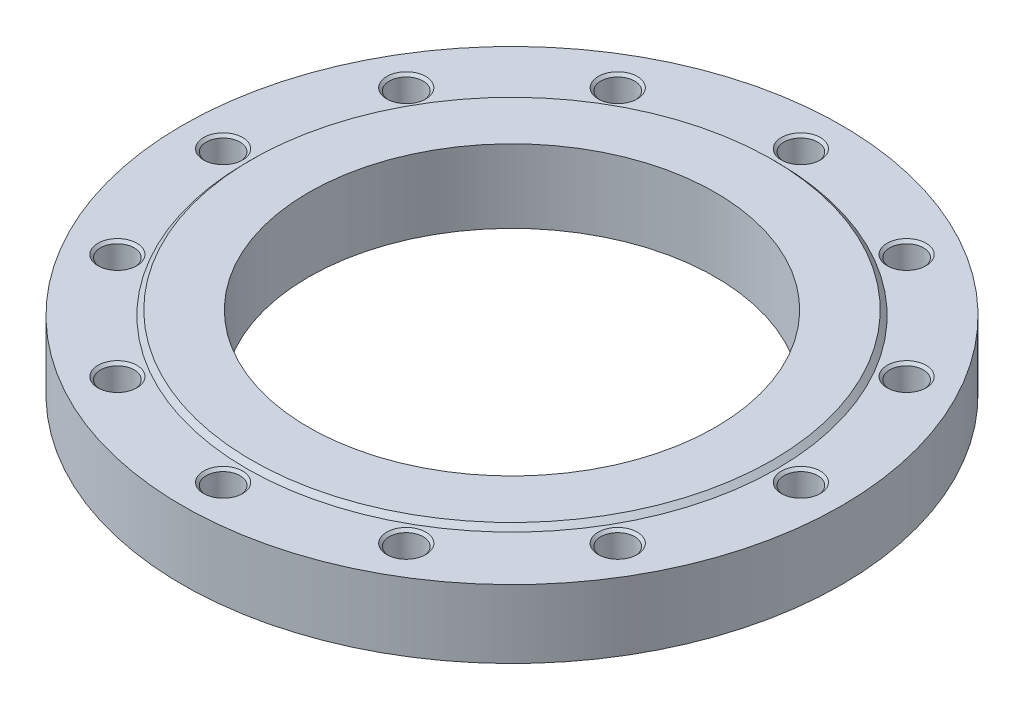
ISO-10303-21;
HEADER;
FILE_DESCRIPTION(('STEP AP214'),'2;1');
FILE_NAME('part.step','',(''),(''),'','','');
FILE_SCHEMA(('AUTOMOTIVE_DESIGN { 1 0 10303 214 1 1 1 1 }'));
ENDSEC;
DATA;
#1=APPLICATION_CONTEXT('core data for automotive mechanical design processes');
#2=APPLICATION_PROTOCOL_DEFINITION('international standard','automotive_design',2000,#1);
#3=PRODUCT_CONTEXT('',#1,'mechanical');
#4=PRODUCT('Part','Part','',(#3));
#5=PRODUCT_RELATED_PRODUCT_CATEGORY('part','',(#4));
#6=PRODUCT_DEFINITION_FORMATION('','',#4);
#7=PRODUCT_DEFINITION_CONTEXT('part definition',#1,'design');
#8=PRODUCT_DEFINITION('design','',#6,#7);
#9=PRODUCT_DEFINITION_SHAPE('','',#8);
#10=(LENGTH_UNIT() NAMED_UNIT(*) SI_UNIT(.MILLI.,.METRE.));
#11=(NAMED_UNIT(*) PLANE_ANGLE_UNIT() SI_UNIT($,.RADIAN.));
#12=(NAMED_UNIT(*) SI_UNIT($,.STERADIAN.) SOLID_ANGLE_UNIT());
#13=UNCERTAINTY_MEASURE_WITH_UNIT(LENGTH_MEASURE(1.E-05),#10,'distance_accuracy_value','');
#14=(GEOMETRIC_REPRESENTATION_CONTEXT(3) GLOBAL_UNCERTAINTY_ASSIGNED_CONTEXT((#13)) GLOBAL_UNIT_ASSIGNED_CONTEXT((#10,
#11,#12)) REPRESENTATION_CONTEXT('',''));
#15=CARTESIAN_POINT('',(0.,0.,0.));
#16=DIRECTION('',(0.,0.,1.));
#17=DIRECTION('',(1.,0.,0.));
#18=AXIS2_PLACEMENT_3D('',#15,#16,#17);
#19=CARTESIAN_POINT('',(0.,21.,0.));
#20=DIRECTION('',(0.,-1.,0.));
#21=DIRECTION('',(1.,0.,0.));
#22=AXIS2_PLACEMENT_3D('',#19,#20,#21);
#23=CYLINDRICAL_SURFACE('',#22,202.5);
#24=CARTESIAN_POINT('',(0.,0.,0.));
#25=DIRECTION('',(0.,1.,0.));
#26=DIRECTION('',(1.,0.,0.));
#27=AXIS2_PLACEMENT_3D('',#24,#25,#26);
#28=CIRCLE('',#27,202.5);
#29=CARTESIAN_POINT('',(202.5,0.,0.));
#30=VERTEX_POINT('',#29);
#31=EDGE_CURVE('E9',#30,#30,#28,.T.);
#32=ORIENTED_EDGE('',*,*,#31,.T.);
#33=EDGE_LOOP('',(#32));
#34=FACE_BOUND('',#33,.T.);
#35=CARTESIAN_POINT('',(0.,42.,0.));
#36=DIRECTION('',(0.,1.,0.));
#37=DIRECTION('',(1.,0.,0.));
#38=AXIS2_PLACEMENT_3D('',#35,#36,#37);
#39=CIRCLE('',#38,202.5);
#40=CARTESIAN_POINT('',(202.5,42.,0.));
#41=VERTEX_POINT('',#40);
#42=EDGE_CURVE('E366',#41,#41,#39,.T.);
#43=ORIENTED_EDGE('',*,*,#42,.F.);
#44=EDGE_LOOP('',(#43));
#45=FACE_BOUND('',#44,.T.);
#46=ADVANCED_FACE('F15',(#34,#45),#23,.T.);
#47=CARTESIAN_POINT('',(163.75,0.,0.));
#48=DIRECTION('',(0.,-1.,0.));
#49=DIRECTION('',(-1.,0.,0.));
#50=AXIS2_PLACEMENT_3D('',#47,#48,#49);
#51=PLANE('',#50);
#52=CARTESIAN_POINT('',(0.,0.,0.));
#53=DIRECTION('',(0.,1.,0.));
#54=DIRECTION('',(1.,0.,0.));
#55=AXIS2_PLACEMENT_3D('',#52,#53,#54);
#56=CIRCLE('',#55,125.);
#57=CARTESIAN_POINT('',(125.,0.,0.));
#58=VERTEX_POINT('',#57);
#59=EDGE_CURVE('E22',#58,#58,#56,.T.);
#60=ORIENTED_EDGE('',*,*,#59,.T.);
#61=EDGE_LOOP('',(#60));
#62=FACE_BOUND('',#61,.T.);
#63=ORIENTED_EDGE('',*,*,#31,.F.);
#64=EDGE_LOOP('',(#63));
#65=FACE_BOUND('',#64,.T.);
#66=ADVANCED_FACE('F467',(#62,#65),#51,.T.);
#67=CARTESIAN_POINT('',(0.,22.5,0.));
#68=DIRECTION('',(0.,-1.,0.));
#69=DIRECTION('',(1.,0.,0.));
#70=AXIS2_PLACEMENT_3D('',#67,#68,#69);
#71=CYLINDRICAL_SURFACE('',#70,125.);
#72=CARTESIAN_POINT('',(0.,45.,0.));
#73=DIRECTION('',(0.,1.,0.));
#74=DIRECTION('',(1.,0.,0.));
#75=AXIS2_PLACEMENT_3D('',#72,#73,#74);
#76=CIRCLE('',#75,125.);
#77=CARTESIAN_POINT('',(125.,45.,0.));
#78=VERTEX_POINT('',#77);
#79=EDGE_CURVE('E449',#78,#78,#76,.T.);
#80=ORIENTED_EDGE('',*,*,#79,.T.);
#81=EDGE_LOOP('',(#80));
#82=FACE_BOUND('',#81,.T.);
#83=ORIENTED_EDGE('',*,*,#59,.F.);
#84=EDGE_LOOP('',(#83));
#85=FACE_BOUND('',#84,.T.);
#86=ADVANCED_FACE('F452',(#82,#85),#71,.F.);
#87=CARTESIAN_POINT('',(142.5,45.,0.));
#88=DIRECTION('',(0.,1.,0.));
#89=DIRECTION('',(1.,0.,0.));
#90=AXIS2_PLACEMENT_3D('',#87,#88,#89);
#91=PLANE('',#90);
#92=CARTESIAN_POINT('',(0.,45.,0.));
#93=DIRECTION('',(0.,1.,0.));
#94=DIRECTION('',(1.,0.,0.));
#95=AXIS2_PLACEMENT_3D('',#92,#93,#94);
#96=CIRCLE('',#95,160.);
#97=CARTESIAN_POINT('',(160.,45.,0.));
#98=VERTEX_POINT('',#97);
#99=EDGE_CURVE('E447',#98,#98,#96,.T.);
#100=ORIENTED_EDGE('',*,*,#99,.T.);
#101=EDGE_LOOP('',(#100));
#102=FACE_BOUND('',#101,.T.);
#103=ORIENTED_EDGE('',*,*,#79,.F.);
#104=EDGE_LOOP('',(#103));
#105=FACE_BOUND('',#104,.T.);
#106=ADVANCED_FACE('F455',(#102,#105),#91,.T.);
#107=CARTESIAN_POINT('',(0.,43.5,0.));
#108=DIRECTION('',(0.,-1.,0.));
#109=DIRECTION('',(1.,0.,0.));
#110=AXIS2_PLACEMENT_3D('',#107,#108,#109);
#111=CONICAL_SURFACE('',#110,161.5,0.785398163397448);
#112=CARTESIAN_POINT('',(0.,42.,0.));
#113=DIRECTION('',(0.,1.,0.));
#114=DIRECTION('',(1.,0.,0.));
#115=AXIS2_PLACEMENT_3D('',#112,#113,#114);
#116=CIRCLE('',#115,163.);
#117=CARTESIAN_POINT('',(163.,42.,0.));
#118=VERTEX_POINT('',#117);
#119=EDGE_CURVE('E325',#118,#118,#116,.T.);
#120=ORIENTED_EDGE('',*,*,#119,.T.);
#121=EDGE_LOOP('',(#120));
#122=FACE_BOUND('',#121,.T.);
#123=ORIENTED_EDGE('',*,*,#99,.F.);
#124=EDGE_LOOP('',(#123));
#125=FACE_BOUND('',#124,.T.);
#126=ADVANCED_FACE('F457',(#122,#125),#111,.T.);
#127=CARTESIAN_POINT('',(182.75,42.,0.));
#128=DIRECTION('',(0.,1.,0.));
#129=DIRECTION('',(1.,0.,0.));
#130=AXIS2_PLACEMENT_3D('',#127,#128,#129);
#131=PLANE('',#130);
#132=ORIENTED_EDGE('',*,*,#42,.T.);
#133=EDGE_LOOP('',(#132));
#134=FACE_BOUND('',#133,.T.);
#135=ORIENTED_EDGE('',*,*,#119,.F.);
#136=EDGE_LOOP('',(#135));
#137=FACE_BOUND('',#136,.T.);
#138=CARTESIAN_POINT('',(177.5,42.,0.));
#139=DIRECTION('',(0.,-1.,0.));
#140=DIRECTION('',(1.,0.,0.));
#141=AXIS2_PLACEMENT_3D('',#138,#139,#140);
#142=CIRCLE('',#141,12.);
#143=CARTESIAN_POINT('',(189.5,42.,0.));
#144=VERTEX_POINT('',#143);
#145=EDGE_CURVE('E355',#144,#144,#142,.T.);
#146=ORIENTED_EDGE('',*,*,#145,.T.);
#147=EDGE_LOOP('',(#146));
#148=FACE_BOUND('',#147,.T.);
#149=CARTESIAN_POINT('',(153.719509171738,42.,-88.75));
#150=DIRECTION('',(0.,-1.,0.));
#151=DIRECTION('',(0.866025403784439,0.,-0.5));
#152=AXIS2_PLACEMENT_3D('',#149,#150,#151);
#153=CIRCLE('',#152,12.);
#154=CARTESIAN_POINT('',(164.111814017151,42.,-94.75));
#155=VERTEX_POINT('',#154);
#156=EDGE_CURVE('E434',#155,#155,#153,.T.);
#157=ORIENTED_EDGE('',*,*,#156,.T.);
#158=EDGE_LOOP('',(#157));
#159=FACE_BOUND('',#158,.T.);
#160=CARTESIAN_POINT('',(88.75,42.,-153.719509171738));
#161=DIRECTION('',(0.,-1.,0.));
#162=DIRECTION('',(0.5,0.,-0.866025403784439));
#163=AXIS2_PLACEMENT_3D('',#160,#161,#162);
#164=CIRCLE('',#163,12.);
#165=CARTESIAN_POINT('',(94.75,42.,-164.111814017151));
#166=VERTEX_POINT('',#165);
#167=EDGE_CURVE('E346',#166,#166,#164,.T.);
#168=ORIENTED_EDGE('',*,*,#167,.T.);
#169=EDGE_LOOP('',(#168));
#170=FACE_BOUND('',#169,.T.);
#171=CARTESIAN_POINT('',(0.,42.,-177.5));
#172=DIRECTION('',(0.,-1.,0.));
#173=DIRECTION('',(0.,0.,-1.));
#174=AXIS2_PLACEMENT_3D('',#171,#172,#173);
#175=CIRCLE('',#174,12.);
#176=CARTESIAN_POINT('',(0.,42.,-189.5));
#177=VERTEX_POINT('',#176);
#178=EDGE_CURVE('E411',#177,#177,#175,.T.);
#179=ORIENTED_EDGE('',*,*,#178,.T.);
#180=EDGE_LOOP('',(#179));
#181=FACE_BOUND('',#180,.T.);
#182=CARTESIAN_POINT('',(-88.75,42.,-153.719509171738));
#183=DIRECTION('',(0.,-1.,0.));
#184=DIRECTION('',(-0.5,0.,-0.866025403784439));
#185=AXIS2_PLACEMENT_3D('',#182,#183,#184);
#186=CIRCLE('',#185,12.);
#187=CARTESIAN_POINT('',(-94.75,42.,-164.111814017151));
#188=VERTEX_POINT('',#187);
#189=EDGE_CURVE('E380',#188,#188,#186,.T.);
#190=ORIENTED_EDGE('',*,*,#189,.T.);
#191=EDGE_LOOP('',(#190));
#192=FACE_BOUND('',#191,.T.);
#193=CARTESIAN_POINT('',(-153.719509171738,42.,-88.75));
#194=DIRECTION('',(0.,-1.,0.));
#195=DIRECTION('',(-0.866025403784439,0.,-0.5));
#196=AXIS2_PLACEMENT_3D('',#193,#194,#195);
#197=CIRCLE('',#196,12.);
#198=CARTESIAN_POINT('',(-164.111814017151,42.,-94.75));
#199=VERTEX_POINT('',#198);
#200=EDGE_CURVE('E331',#199,#199,#197,.T.);
#201=ORIENTED_EDGE('',*,*,#200,.T.);
#202=EDGE_LOOP('',(#201));
#203=FACE_BOUND('',#202,.T.);
#204=CARTESIAN_POINT('',(-177.5,42.,0.));
#205=DIRECTION('',(0.,-1.,0.));
#206=DIRECTION('',(-1.,0.,0.));
#207=AXIS2_PLACEMENT_3D('',#204,#205,#206);
#208=CIRCLE('',#207,12.);
#209=CARTESIAN_POINT('',(-189.5,42.,0.));
#210=VERTEX_POINT('',#209);
#211=EDGE_CURVE('E395',#210,#210,#208,.T.);
#212=ORIENTED_EDGE('',*,*,#211,.T.);
#213=EDGE_LOOP('',(#212));
#214=FACE_BOUND('',#213,.T.);
#215=CARTESIAN_POINT('',(-153.719509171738,42.,88.75));
#216=DIRECTION('',(0.,-1.,0.));
#217=DIRECTION('',(-0.866025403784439,0.,0.5));
#218=AXIS2_PLACEMENT_3D('',#215,#216,#217);
#219=CIRCLE('',#218,12.);
#220=CARTESIAN_POINT('',(-164.111814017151,42.,94.75));
#221=VERTEX_POINT('',#220);
#222=EDGE_CURVE('E376',#221,#221,#219,.T.);
#223=ORIENTED_EDGE('',*,*,#222,.T.);
#224=EDGE_LOOP('',(#223));
#225=FACE_BOUND('',#224,.T.);
#226=CARTESIAN_POINT('',(-88.75,42.,153.719509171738));
#227=DIRECTION('',(0.,-1.,0.));
#228=DIRECTION('',(-0.5,0.,0.866025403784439));
#229=AXIS2_PLACEMENT_3D('',#226,#227,#228);
#230=CIRCLE('',#229,12.);
#231=CARTESIAN_POINT('',(-94.75,42.,164.111814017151));
#232=VERTEX_POINT('',#231);
#233=EDGE_CURVE('E351',#232,#232,#230,.T.);
#234=ORIENTED_EDGE('',*,*,#233,.T.);
#235=EDGE_LOOP('',(#234));
#236=FACE_BOUND('',#235,.T.);
#237=CARTESIAN_POINT('',(0.,42.,177.5));
#238=DIRECTION('',(0.,-1.,0.));
#239=DIRECTION('',(0.,0.,1.));
#240=AXIS2_PLACEMENT_3D('',#237,#238,#239);
#241=CIRCLE('',#240,12.);
#242=CARTESIAN_POINT('',(0.,42.,189.5));
#243=VERTEX_POINT('',#242);
#244=EDGE_CURVE('E316',#243,#243,#241,.T.);
#245=ORIENTED_EDGE('',*,*,#244,.T.);
#246=EDGE_LOOP('',(#245));
#247=FACE_BOUND('',#246,.T.);
#248=CARTESIAN_POINT('',(88.75,42.,153.719509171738));
#249=DIRECTION('',(0.,-1.,0.));
#250=DIRECTION('',(0.5,0.,0.866025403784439));
#251=AXIS2_PLACEMENT_3D('',#248,#249,#250);
#252=CIRCLE('',#251,12.);
#253=CARTESIAN_POINT('',(94.75,42.,164.111814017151));
#254=VERTEX_POINT('',#253);
#255=EDGE_CURVE('E295',#254,#254,#252,.T.);
#256=ORIENTED_EDGE('',*,*,#255,.T.);
#257=EDGE_LOOP('',(#256));
#258=FACE_BOUND('',#257,.T.);
#259=CARTESIAN_POINT('',(153.719509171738,42.,88.75));
#260=DIRECTION('',(0.,-1.,0.));
#261=DIRECTION('',(0.866025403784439,0.,0.5));
#262=AXIS2_PLACEMENT_3D('',#259,#260,#261);
#263=CIRCLE('',#262,12.);
#264=CARTESIAN_POINT('',(164.111814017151,42.,94.75));
#265=VERTEX_POINT('',#264);
#266=EDGE_CURVE('E313',#265,#265,#263,.T.);
#267=ORIENTED_EDGE('',*,*,#266,.T.);
#268=EDGE_LOOP('',(#267));
#269=FACE_BOUND('',#268,.T.);
#270=ADVANCED_FACE('F296',(#134,#137,#148,#159,#170,#181,#192,#203,#214,#225,#236,#247,#258,
#269),#131,.T.);
#271=CARTESIAN_POINT('',(177.5,6.00463463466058,0.));
#272=DIRECTION('',(0.,1.,0.));
#273=DIRECTION('',(1.,0.,0.));
#274=AXIS2_PLACEMENT_3D('',#271,#272,#273);
#275=CONICAL_SURFACE('',#274,5.188125,1.0471975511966);
#276=CARTESIAN_POINT('',(177.5,9.,0.));
#277=DIRECTION('',(0.,-1.,0.));
#278=DIRECTION('',(1.,0.,0.));
#279=AXIS2_PLACEMENT_3D('',#276,#277,#278);
#280=CIRCLE('',#279,10.37625);
#281=CARTESIAN_POINT('',(187.87625,9.,0.));
#282=VERTEX_POINT('',#281);
#283=EDGE_CURVE('E323',#282,#282,#280,.T.);
#284=ORIENTED_EDGE('',*,*,#283,.F.);
#285=EDGE_LOOP('',(#284));
#286=FACE_BOUND('',#285,.T.);
#287=CARTESIAN_POINT('',(177.5,3.00926926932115,0.));
#288=VERTEX_POINT('',#287);
#289=VERTEX_LOOP('',#288);
#290=FACE_BOUND('',#289,.T.);
#291=ADVANCED_FACE('F478',(#286,#290),#275,.F.);
#292=CARTESIAN_POINT('',(177.5,12.688125,0.));
#293=DIRECTION('',(0.,1.,0.));
#294=DIRECTION('',(1.,0.,0.));
#295=AXIS2_PLACEMENT_3D('',#292,#293,#294);
#296=CYLINDRICAL_SURFACE('',#295,10.37625);
#297=CARTESIAN_POINT('',(177.5,16.37625,0.));
#298=DIRECTION('',(0.,-1.,0.));
#299=DIRECTION('',(1.,0.,0.));
#300=AXIS2_PLACEMENT_3D('',#297,#298,#299);
#301=CIRCLE('',#300,10.37625);
#302=CARTESIAN_POINT('',(187.87625,16.37625,0.));
#303=VERTEX_POINT('',#302);
#304=EDGE_CURVE('E326',#303,#303,#301,.T.);
#305=ORIENTED_EDGE('',*,*,#304,.F.);
#306=EDGE_LOOP('',(#305));
#307=FACE_BOUND('',#306,.T.);
#308=ORIENTED_EDGE('',*,*,#283,.T.);
#309=EDGE_LOOP('',(#308));
#310=FACE_BOUND('',#309,.T.);
#311=ADVANCED_FACE('F563',(#307,#310),#296,.F.);
#312=CARTESIAN_POINT('',(177.5,17.188125,0.));
#313=DIRECTION('',(0.,1.,0.));
#314=DIRECTION('',(1.,0.,0.));
#315=AXIS2_PLACEMENT_3D('',#312,#313,#314);
#316=CONICAL_SURFACE('',#315,11.188125,0.785398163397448);
#317=CARTESIAN_POINT('',(177.5,18.,0.));
#318=DIRECTION('',(0.,-1.,0.));
#319=DIRECTION('',(1.,0.,0.));
#320=AXIS2_PLACEMENT_3D('',#317,#318,#319);
#321=CIRCLE('',#320,12.);
#322=CARTESIAN_POINT('',(189.5,18.,0.));
#323=VERTEX_POINT('',#322);
#324=EDGE_CURVE('E354',#323,#323,#321,.T.);
#325=ORIENTED_EDGE('',*,*,#324,.F.);
#326=EDGE_LOOP('',(#325));
#327=FACE_BOUND('',#326,.T.);
#328=ORIENTED_EDGE('',*,*,#304,.T.);
#329=EDGE_LOOP('',(#328));
#330=FACE_BOUND('',#329,.T.);
#331=ADVANCED_FACE('F739',(#327,#330),#316,.F.);
#332=CARTESIAN_POINT('',(188.688125,18.,0.));
#333=DIRECTION('',(0.,1.,0.));
#334=DIRECTION('',(-1.,0.,0.));
#335=AXIS2_PLACEMENT_3D('',#332,#333,#334);
#336=PLANE('',#335);
#337=CARTESIAN_POINT('',(177.5,18.,0.));
#338=DIRECTION('',(0.,-1.,0.));
#339=DIRECTION('',(1.,0.,0.));
#340=AXIS2_PLACEMENT_3D('',#337,#338,#339);
#341=CIRCLE('',#340,10.37625);
#342=CARTESIAN_POINT('',(187.87625,18.,0.));
#343=VERTEX_POINT('',#342);
#344=EDGE_CURVE('E352',#343,#343,#341,.T.);
#345=ORIENTED_EDGE('',*,*,#344,.F.);
#346=EDGE_LOOP('',(#345));
#347=FACE_BOUND('',#346,.T.);
#348=ORIENTED_EDGE('',*,*,#324,.T.);
#349=EDGE_LOOP('',(#348));
#350=FACE_BOUND('',#349,.T.);
#351=ADVANCED_FACE('F736',(#347,#350),#336,.F.);
#352=CARTESIAN_POINT('',(177.5,29.188125,0.));
#353=DIRECTION('',(0.,1.,0.));
#354=DIRECTION('',(1.,0.,0.));
#355=AXIS2_PLACEMENT_3D('',#352,#353,#354);
#356=CYLINDRICAL_SURFACE('',#355,10.37625);
#357=CARTESIAN_POINT('',(177.5,40.37625,0.));
#358=DIRECTION('',(0.,-1.,0.));
#359=DIRECTION('',(1.,0.,0.));
#360=AXIS2_PLACEMENT_3D('',#357,#358,#359);
#361=CIRCLE('',#360,10.37625);
#362=CARTESIAN_POINT('',(187.87625,40.37625,0.));
#363=VERTEX_POINT('',#362);
#364=EDGE_CURVE('E416',#363,#363,#361,.T.);
#365=ORIENTED_EDGE('',*,*,#364,.F.);
#366=EDGE_LOOP('',(#365));
#367=FACE_BOUND('',#366,.T.);
#368=ORIENTED_EDGE('',*,*,#344,.T.);
#369=EDGE_LOOP('',(#368));
#370=FACE_BOUND('',#369,.T.);
#371=ADVANCED_FACE('F591',(#367,#370),#356,.F.);
#372=CARTESIAN_POINT('',(177.5,41.188125,0.));
#373=DIRECTION('',(0.,1.,0.));
#374=DIRECTION('',(1.,0.,0.));
#375=AXIS2_PLACEMENT_3D('',#372,#373,#374);
#376=CONICAL_SURFACE('',#375,11.188125,0.785398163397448);
#377=ORIENTED_EDGE('',*,*,#145,.F.);
#378=EDGE_LOOP('',(#377));
#379=FACE_BOUND('',#378,.T.);
#380=ORIENTED_EDGE('',*,*,#364,.T.);
#381=EDGE_LOOP('',(#380));
#382=FACE_BOUND('',#381,.T.);
#383=ADVANCED_FACE('F587',(#379,#382),#376,.F.);
#384=CARTESIAN_POINT('',(153.719509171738,6.00463463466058,-88.75));
#385=DIRECTION('',(0.,1.,0.));
#386=DIRECTION('',(0.866025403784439,0.,-0.5));
#387=AXIS2_PLACEMENT_3D('',#384,#385,#386);
#388=CONICAL_SURFACE('',#387,5.188125,1.0471975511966);
#389=CARTESIAN_POINT('',(153.719509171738,9.,-88.75));
#390=DIRECTION('',(0.,-1.,0.));
#391=DIRECTION('',(0.866025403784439,0.,-0.5));
#392=AXIS2_PLACEMENT_3D('',#389,#390,#391);
#393=CIRCLE('',#392,10.37625);
#394=CARTESIAN_POINT('',(162.705605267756,9.,-93.938125));
#395=VERTEX_POINT('',#394);
#396=EDGE_CURVE('E418',#395,#395,#393,.T.);
#397=ORIENTED_EDGE('',*,*,#396,.F.);
#398=EDGE_LOOP('',(#397));
#399=FACE_BOUND('',#398,.T.);
#400=CARTESIAN_POINT('',(153.719509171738,3.00926926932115,-88.75));
#401=VERTEX_POINT('',#400);
#402=VERTEX_LOOP('',#401);
#403=FACE_BOUND('',#402,.T.);
#404=ADVANCED_FACE('F590',(#399,#403),#388,.F.);
#405=CARTESIAN_POINT('',(153.719509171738,12.688125,-88.75));
#406=DIRECTION('',(0.,1.,0.));
#407=DIRECTION('',(0.866025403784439,0.,-0.5));
#408=AXIS2_PLACEMENT_3D('',#405,#406,#407);
#409=CYLINDRICAL_SURFACE('',#408,10.37625);
#410=CARTESIAN_POINT('',(153.719509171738,16.37625,-88.75));
#411=DIRECTION('',(0.,-1.,0.));
#412=DIRECTION('',(0.866025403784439,0.,-0.5));
#413=AXIS2_PLACEMENT_3D('',#410,#411,#412);
#414=CIRCLE('',#413,10.37625);
#415=CARTESIAN_POINT('',(162.705605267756,16.37625,-93.938125));
#416=VERTEX_POINT('',#415);
#417=EDGE_CURVE('E440',#416,#416,#414,.T.);
#418=ORIENTED_EDGE('',*,*,#417,.F.);
#419=EDGE_LOOP('',(#418));
#420=FACE_BOUND('',#419,.T.);
#421=ORIENTED_EDGE('',*,*,#396,.T.);
#422=EDGE_LOOP('',(#421));
#423=FACE_BOUND('',#422,.T.);
#424=ADVANCED_FACE('F731',(#420,#423),#409,.F.);
#425=CARTESIAN_POINT('',(153.719509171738,17.188125,-88.75));
#426=DIRECTION('',(0.,1.,0.));
#427=DIRECTION('',(0.866025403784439,0.,-0.5));
#428=AXIS2_PLACEMENT_3D('',#425,#426,#427);
#429=CONICAL_SURFACE('',#428,11.188125,0.785398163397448);
#430=CARTESIAN_POINT('',(153.719509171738,18.,-88.75));
#431=DIRECTION('',(0.,-1.,0.));
#432=DIRECTION('',(0.866025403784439,0.,-0.5));
#433=AXIS2_PLACEMENT_3D('',#430,#431,#432);
#434=CIRCLE('',#433,12.);
#435=CARTESIAN_POINT('',(164.111814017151,18.,-94.75));
#436=VERTEX_POINT('',#435);
#437=EDGE_CURVE('E438',#436,#436,#434,.T.);
#438=ORIENTED_EDGE('',*,*,#437,.F.);
#439=EDGE_LOOP('',(#438));
#440=FACE_BOUND('',#439,.T.);
#441=ORIENTED_EDGE('',*,*,#417,.T.);
#442=EDGE_LOOP('',(#441));
#443=FACE_BOUND('',#442,.T.);
#444=ADVANCED_FACE('F727',(#440,#443),#429,.F.);
#445=CARTESIAN_POINT('',(163.408709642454,18.,-94.3440625));
#446=DIRECTION('',(0.,1.,0.));
#447=DIRECTION('',(-0.866025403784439,0.,0.5));
#448=AXIS2_PLACEMENT_3D('',#445,#446,#447);
#449=PLANE('',#448);
#450=CARTESIAN_POINT('',(153.719509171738,18.,-88.75));
#451=DIRECTION('',(0.,-1.,0.));
#452=DIRECTION('',(0.866025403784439,0.,-0.5));
#453=AXIS2_PLACEMENT_3D('',#450,#451,#452);
#454=CIRCLE('',#453,10.37625);
#455=CARTESIAN_POINT('',(162.705605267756,18.,-93.938125));
#456=VERTEX_POINT('',#455);
#457=EDGE_CURVE('E436',#456,#456,#454,.T.);
#458=ORIENTED_EDGE('',*,*,#457,.F.);
#459=EDGE_LOOP('',(#458));
#460=FACE_BOUND('',#459,.T.);
#461=ORIENTED_EDGE('',*,*,#437,.T.);
#462=EDGE_LOOP('',(#461));
#463=FACE_BOUND('',#462,.T.);
#464=ADVANCED_FACE('F723',(#460,#463),#449,.F.);
#465=CARTESIAN_POINT('',(153.719509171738,29.188125,-88.75));
#466=DIRECTION('',(0.,1.,0.));
#467=DIRECTION('',(0.866025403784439,0.,-0.5));
#468=AXIS2_PLACEMENT_3D('',#465,#466,#467);
#469=CYLINDRICAL_SURFACE('',#468,10.37625);
#470=CARTESIAN_POINT('',(153.719509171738,40.37625,-88.75));
#471=DIRECTION('',(0.,-1.,0.));
#472=DIRECTION('',(0.866025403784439,0.,-0.5));
#473=AXIS2_PLACEMENT_3D('',#470,#471,#472);
#474=CIRCLE('',#473,10.37625);
#475=CARTESIAN_POINT('',(162.705605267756,40.37625,-93.938125));
#476=VERTEX_POINT('',#475);
#477=EDGE_CURVE('E432',#476,#476,#474,.T.);
#478=ORIENTED_EDGE('',*,*,#477,.F.);
#479=EDGE_LOOP('',(#478));
#480=FACE_BOUND('',#479,.T.);
#481=ORIENTED_EDGE('',*,*,#457,.T.);
#482=EDGE_LOOP('',(#481));
#483=FACE_BOUND('',#482,.T.);
#484=ADVANCED_FACE('F719',(#480,#483),#469,.F.);
#485=CARTESIAN_POINT('',(153.719509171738,41.188125,-88.75));
#486=DIRECTION('',(0.,1.,0.));
#487=DIRECTION('',(0.866025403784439,0.,-0.5));
#488=AXIS2_PLACEMENT_3D('',#485,#486,#487);
#489=CONICAL_SURFACE('',#488,11.188125,0.785398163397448);
#490=ORIENTED_EDGE('',*,*,#156,.F.);
#491=EDGE_LOOP('',(#490));
#492=FACE_BOUND('',#491,.T.);
#493=ORIENTED_EDGE('',*,*,#477,.T.);
#494=EDGE_LOOP('',(#493));
#495=FACE_BOUND('',#494,.T.);
#496=ADVANCED_FACE('F715',(#492,#495),#489,.F.);
#497=CARTESIAN_POINT('',(88.75,6.00463463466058,-153.719509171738));
#498=DIRECTION('',(0.,1.,0.));
#499=DIRECTION('',(0.5,0.,-0.866025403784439));
#500=AXIS2_PLACEMENT_3D('',#497,#498,#499);
#501=CONICAL_SURFACE('',#500,5.188125,1.0471975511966);
#502=CARTESIAN_POINT('',(88.75,9.,-153.719509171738));
#503=DIRECTION('',(0.,-1.,0.));
#504=DIRECTION('',(0.5,0.,-0.866025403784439));
#505=AXIS2_PLACEMENT_3D('',#502,#503,#504);
#506=CIRCLE('',#505,10.37625);
#507=CARTESIAN_POINT('',(93.938125,9.,-162.705605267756));
#508=VERTEX_POINT('',#507);
#509=EDGE_CURVE('E430',#508,#508,#506,.T.);
#510=ORIENTED_EDGE('',*,*,#509,.F.);
#511=EDGE_LOOP('',(#510));
#512=FACE_BOUND('',#511,.T.);
#513=CARTESIAN_POINT('',(88.75,3.00926926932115,-153.719509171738));
#514=VERTEX_POINT('',#513);
#515=VERTEX_LOOP('',#514);
#516=FACE_BOUND('',#515,.T.);
#517=ADVANCED_FACE('F711',(#512,#516),#501,.F.);
#518=CARTESIAN_POINT('',(88.75,12.688125,-153.719509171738));
#519=DIRECTION('',(0.,1.,0.));
#520=DIRECTION('',(0.5,0.,-0.866025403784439));
#521=AXIS2_PLACEMENT_3D('',#518,#519,#520);
#522=CYLINDRICAL_SURFACE('',#521,10.37625);
#523=CARTESIAN_POINT('',(88.75,16.37625,-153.719509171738));
#524=DIRECTION('',(0.,-1.,0.));
#525=DIRECTION('',(0.5,0.,-0.866025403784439));
#526=AXIS2_PLACEMENT_3D('',#523,#524,#525);
#527=CIRCLE('',#526,10.37625);
#528=CARTESIAN_POINT('',(93.938125,16.37625,-162.705605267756));
#529=VERTEX_POINT('',#528);
#530=EDGE_CURVE('E428',#529,#529,#527,.T.);
#531=ORIENTED_EDGE('',*,*,#530,.F.);
#532=EDGE_LOOP('',(#531));
#533=FACE_BOUND('',#532,.T.);
#534=ORIENTED_EDGE('',*,*,#509,.T.);
#535=EDGE_LOOP('',(#534));
#536=FACE_BOUND('',#535,.T.);
#537=ADVANCED_FACE('F707',(#533,#536),#522,.F.);
#538=CARTESIAN_POINT('',(88.75,17.188125,-153.719509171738));
#539=DIRECTION('',(0.,1.,0.));
#540=DIRECTION('',(0.5,0.,-0.866025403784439));
#541=AXIS2_PLACEMENT_3D('',#538,#539,#540);
#542=CONICAL_SURFACE('',#541,11.188125,0.785398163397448);
#543=CARTESIAN_POINT('',(88.75,18.,-153.719509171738));
#544=DIRECTION('',(0.,-1.,0.));
#545=DIRECTION('',(0.5,0.,-0.866025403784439));
#546=AXIS2_PLACEMENT_3D('',#543,#544,#545);
#547=CIRCLE('',#546,12.);
#548=CARTESIAN_POINT('',(94.75,18.,-164.111814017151));
#549=VERTEX_POINT('',#548);
#550=EDGE_CURVE('E426',#549,#549,#547,.T.);
#551=ORIENTED_EDGE('',*,*,#550,.F.);
#552=EDGE_LOOP('',(#551));
#553=FACE_BOUND('',#552,.T.);
#554=ORIENTED_EDGE('',*,*,#530,.T.);
#555=EDGE_LOOP('',(#554));
#556=FACE_BOUND('',#555,.T.);
#557=ADVANCED_FACE('F703',(#553,#556),#542,.F.);
#558=CARTESIAN_POINT('',(94.3440625,18.,-163.408709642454));
#559=DIRECTION('',(0.,1.,0.));
#560=DIRECTION('',(-0.5,0.,0.866025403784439));
#561=AXIS2_PLACEMENT_3D('',#558,#559,#560);
#562=PLANE('',#561);
#563=CARTESIAN_POINT('',(88.75,18.,-153.719509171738));
#564=DIRECTION('',(0.,-1.,0.));
#565=DIRECTION('',(0.5,0.,-0.866025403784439));
#566=AXIS2_PLACEMENT_3D('',#563,#564,#565);
#567=CIRCLE('',#566,10.37625);
#568=CARTESIAN_POINT('',(93.938125,18.,-162.705605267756));
#569=VERTEX_POINT('',#568);
#570=EDGE_CURVE('E348',#569,#569,#567,.T.);
#571=ORIENTED_EDGE('',*,*,#570,.F.);
#572=EDGE_LOOP('',(#571));
#573=FACE_BOUND('',#572,.T.);
#574=ORIENTED_EDGE('',*,*,#550,.T.);
#575=EDGE_LOOP('',(#574));
#576=FACE_BOUND('',#575,.T.);
#577=ADVANCED_FACE('F699',(#573,#576),#562,.F.);
#578=CARTESIAN_POINT('',(88.75,29.188125,-153.719509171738));
#579=DIRECTION('',(0.,1.,0.));
#580=DIRECTION('',(0.5,0.,-0.866025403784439));
#581=AXIS2_PLACEMENT_3D('',#578,#579,#580);
#582=CYLINDRICAL_SURFACE('',#581,10.37625);
#583=CARTESIAN_POINT('',(88.75,40.37625,-153.719509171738));
#584=DIRECTION('',(0.,-1.,0.));
#585=DIRECTION('',(0.5,0.,-0.866025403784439));
#586=AXIS2_PLACEMENT_3D('',#583,#584,#585);
#587=CIRCLE('',#586,10.37625);
#588=CARTESIAN_POINT('',(93.938125,40.37625,-162.705605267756));
#589=VERTEX_POINT('',#588);
#590=EDGE_CURVE('E349',#589,#589,#587,.T.);
#591=ORIENTED_EDGE('',*,*,#590,.F.);
#592=EDGE_LOOP('',(#591));
#593=FACE_BOUND('',#592,.T.);
#594=ORIENTED_EDGE('',*,*,#570,.T.);
#595=EDGE_LOOP('',(#594));
#596=FACE_BOUND('',#595,.T.);
#597=ADVANCED_FACE('F695',(#593,#596),#582,.F.);
#598=CARTESIAN_POINT('',(88.75,41.188125,-153.719509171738));
#599=DIRECTION('',(0.,1.,0.));
#600=DIRECTION('',(0.5,0.,-0.866025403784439));
#601=AXIS2_PLACEMENT_3D('',#598,#599,#600);
#602=CONICAL_SURFACE('',#601,11.188125,0.785398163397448);
#603=ORIENTED_EDGE('',*,*,#167,.F.);
#604=EDGE_LOOP('',(#603));
#605=FACE_BOUND('',#604,.T.);
#606=ORIENTED_EDGE('',*,*,#590,.T.);
#607=EDGE_LOOP('',(#606));
#608=FACE_BOUND('',#607,.T.);
#609=ADVANCED_FACE('F691',(#605,#608),#602,.F.);
#610=CARTESIAN_POINT('',(0.,6.00463463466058,-177.5));
#611=DIRECTION('',(0.,1.,0.));
#612=DIRECTION('',(0.,0.,-1.));
#613=AXIS2_PLACEMENT_3D('',#610,#611,#612);
#614=CONICAL_SURFACE('',#613,5.188125,1.0471975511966);
#615=CARTESIAN_POINT('',(0.,9.,-177.5));
#616=DIRECTION('',(0.,-1.,0.));
#617=DIRECTION('',(0.,0.,-1.));
#618=AXIS2_PLACEMENT_3D('',#615,#616,#617);
#619=CIRCLE('',#618,10.37625);
#620=CARTESIAN_POINT('',(0.,9.,-187.87625));
#621=VERTEX_POINT('',#620);
#622=EDGE_CURVE('E422',#621,#621,#619,.T.);
#623=ORIENTED_EDGE('',*,*,#622,.F.);
#624=EDGE_LOOP('',(#623));
#625=FACE_BOUND('',#624,.T.);
#626=CARTESIAN_POINT('',(0.,3.00926926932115,-177.5));
#627=VERTEX_POINT('',#626);
#628=VERTEX_LOOP('',#627);
#629=FACE_BOUND('',#628,.T.);
#630=ADVANCED_FACE('F687',(#625,#629),#614,.F.);
#631=CARTESIAN_POINT('',(0.,12.688125,-177.5));
#632=DIRECTION('',(0.,1.,0.));
#633=DIRECTION('',(0.,0.,-1.));
#634=AXIS2_PLACEMENT_3D('',#631,#632,#633);
#635=CYLINDRICAL_SURFACE('',#634,10.37625);
#636=CARTESIAN_POINT('',(0.,16.37625,-177.5));
#637=DIRECTION('',(0.,-1.,0.));
#638=DIRECTION('',(0.,0.,-1.));
#639=AXIS2_PLACEMENT_3D('',#636,#637,#638);
#640=CIRCLE('',#639,10.37625);
#641=CARTESIAN_POINT('',(0.,16.37625,-187.87625));
#642=VERTEX_POINT('',#641);
#643=EDGE_CURVE('E420',#642,#642,#640,.T.);
#644=ORIENTED_EDGE('',*,*,#643,.F.);
#645=EDGE_LOOP('',(#644));
#646=FACE_BOUND('',#645,.T.);
#647=ORIENTED_EDGE('',*,*,#622,.T.);
#648=EDGE_LOOP('',(#647));
#649=FACE_BOUND('',#648,.T.);
#650=ADVANCED_FACE('F683',(#646,#649),#635,.F.);
#651=CARTESIAN_POINT('',(0.,17.188125,-177.5));
#652=DIRECTION('',(0.,1.,0.));
#653=DIRECTION('',(0.,0.,-1.));
#654=AXIS2_PLACEMENT_3D('',#651,#652,#653);
#655=CONICAL_SURFACE('',#654,11.188125,0.785398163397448);
#656=CARTESIAN_POINT('',(0.,18.,-177.5));
#657=DIRECTION('',(0.,-1.,0.));
#658=DIRECTION('',(0.,0.,-1.));
#659=AXIS2_PLACEMENT_3D('',#656,#657,#658);
#660=CIRCLE('',#659,12.);
#661=CARTESIAN_POINT('',(0.,18.,-189.5));
#662=VERTEX_POINT('',#661);
#663=EDGE_CURVE('E415',#662,#662,#660,.T.);
#664=ORIENTED_EDGE('',*,*,#663,.F.);
#665=EDGE_LOOP('',(#664));
#666=FACE_BOUND('',#665,.T.);
#667=ORIENTED_EDGE('',*,*,#643,.T.);
#668=EDGE_LOOP('',(#667));
#669=FACE_BOUND('',#668,.T.);
#670=ADVANCED_FACE('F679',(#666,#669),#655,.F.);
#671=CARTESIAN_POINT('',(0.,18.,-188.688125));
#672=DIRECTION('',(0.,1.,0.));
#673=DIRECTION('',(0.,0.,1.));
#674=AXIS2_PLACEMENT_3D('',#671,#672,#673);
#675=PLANE('',#674);
#676=CARTESIAN_POINT('',(0.,18.,-177.5));
#677=DIRECTION('',(0.,-1.,0.));
#678=DIRECTION('',(0.,0.,-1.));
#679=AXIS2_PLACEMENT_3D('',#676,#677,#678);
#680=CIRCLE('',#679,10.37625);
#681=CARTESIAN_POINT('',(0.,18.,-187.87625));
#682=VERTEX_POINT('',#681);
#683=EDGE_CURVE('E413',#682,#682,#680,.T.);
#684=ORIENTED_EDGE('',*,*,#683,.F.);
#685=EDGE_LOOP('',(#684));
#686=FACE_BOUND('',#685,.T.);
#687=ORIENTED_EDGE('',*,*,#663,.T.);
#688=EDGE_LOOP('',(#687));
#689=FACE_BOUND('',#688,.T.);
#690=ADVANCED_FACE('F675',(#686,#689),#675,.F.);
#691=CARTESIAN_POINT('',(0.,29.188125,-177.5));
#692=DIRECTION('',(0.,1.,0.));
#693=DIRECTION('',(0.,0.,-1.));
#694=AXIS2_PLACEMENT_3D('',#691,#692,#693);
#695=CYLINDRICAL_SURFACE('',#694,10.37625);
#696=CARTESIAN_POINT('',(0.,40.37625,-177.5));
#697=DIRECTION('',(0.,-1.,0.));
#698=DIRECTION('',(0.,0.,-1.));
#699=AXIS2_PLACEMENT_3D('',#696,#697,#698);
#700=CIRCLE('',#699,10.37625);
#701=CARTESIAN_POINT('',(0.,40.37625,-187.87625));
#702=VERTEX_POINT('',#701);
#703=EDGE_CURVE('E409',#702,#702,#700,.T.);
#704=ORIENTED_EDGE('',*,*,#703,.F.);
#705=EDGE_LOOP('',(#704));
#706=FACE_BOUND('',#705,.T.);
#707=ORIENTED_EDGE('',*,*,#683,.T.);
#708=EDGE_LOOP('',(#707));
#709=FACE_BOUND('',#708,.T.);
#710=ADVANCED_FACE('F671',(#706,#709),#695,.F.);
#711=CARTESIAN_POINT('',(0.,41.188125,-177.5));
#712=DIRECTION('',(0.,1.,0.));
#713=DIRECTION('',(0.,0.,-1.));
#714=AXIS2_PLACEMENT_3D('',#711,#712,#713);
#715=CONICAL_SURFACE('',#714,11.188125,0.785398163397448);
#716=ORIENTED_EDGE('',*,*,#178,.F.);
#717=EDGE_LOOP('',(#716));
#718=FACE_BOUND('',#717,.T.);
#719=ORIENTED_EDGE('',*,*,#703,.T.);
#720=EDGE_LOOP('',(#719));
#721=FACE_BOUND('',#720,.T.);
#722=ADVANCED_FACE('F667',(#718,#721),#715,.F.);
#723=CARTESIAN_POINT('',(-88.75,6.00463463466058,-153.719509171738));
#724=DIRECTION('',(0.,1.,0.));
#725=DIRECTION('',(-0.5,0.,-0.866025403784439));
#726=AXIS2_PLACEMENT_3D('',#723,#724,#725);
#727=CONICAL_SURFACE('',#726,5.188125,1.0471975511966);
#728=CARTESIAN_POINT('',(-88.75,9.,-153.719509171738));
#729=DIRECTION('',(0.,-1.,0.));
#730=DIRECTION('',(-0.5,0.,-0.866025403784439));
#731=AXIS2_PLACEMENT_3D('',#728,#729,#730);
#732=CIRCLE('',#731,10.37625);
#733=CARTESIAN_POINT('',(-93.938125,9.,-162.705605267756));
#734=VERTEX_POINT('',#733);
#735=EDGE_CURVE('E385',#734,#734,#732,.T.);
#736=ORIENTED_EDGE('',*,*,#735,.F.);
#737=EDGE_LOOP('',(#736));
#738=FACE_BOUND('',#737,.T.);
#739=CARTESIAN_POINT('',(-88.75,3.00926926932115,-153.719509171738));
#740=VERTEX_POINT('',#739);
#741=VERTEX_LOOP('',#740);
#742=FACE_BOUND('',#741,.T.);
#743=ADVANCED_FACE('F663',(#738,#742),#727,.F.);
#744=CARTESIAN_POINT('',(-88.75,12.688125,-153.719509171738));
#745=DIRECTION('',(0.,1.,0.));
#746=DIRECTION('',(-0.5,0.,-0.866025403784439));
#747=AXIS2_PLACEMENT_3D('',#744,#745,#746);
#748=CYLINDRICAL_SURFACE('',#747,10.37625);
#749=CARTESIAN_POINT('',(-88.75,16.37625,-153.719509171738));
#750=DIRECTION('',(0.,-1.,0.));
#751=DIRECTION('',(-0.5,0.,-0.866025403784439));
#752=AXIS2_PLACEMENT_3D('',#749,#750,#751);
#753=CIRCLE('',#752,10.37625);
#754=CARTESIAN_POINT('',(-93.938125,16.37625,-162.705605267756));
#755=VERTEX_POINT('',#754);
#756=EDGE_CURVE('E383',#755,#755,#753,.T.);
#757=ORIENTED_EDGE('',*,*,#756,.F.);
#758=EDGE_LOOP('',(#757));
#759=FACE_BOUND('',#758,.T.);
#760=ORIENTED_EDGE('',*,*,#735,.T.);
#761=EDGE_LOOP('',(#760));
#762=FACE_BOUND('',#761,.T.);
#763=ADVANCED_FACE('F611',(#759,#762),#748,.F.);
#764=CARTESIAN_POINT('',(-88.75,17.188125,-153.719509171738));
#765=DIRECTION('',(0.,1.,0.));
#766=DIRECTION('',(-0.5,0.,-0.866025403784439));
#767=AXIS2_PLACEMENT_3D('',#764,#765,#766);
#768=CONICAL_SURFACE('',#767,11.188125,0.785398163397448);
#769=CARTESIAN_POINT('',(-88.75,18.,-153.719509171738));
#770=DIRECTION('',(0.,-1.,0.));
#771=DIRECTION('',(-0.5,0.,-0.866025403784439));
#772=AXIS2_PLACEMENT_3D('',#769,#770,#771);
#773=CIRCLE('',#772,12.);
#774=CARTESIAN_POINT('',(-94.75,18.,-164.111814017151));
#775=VERTEX_POINT('',#774);
#776=EDGE_CURVE('E379',#775,#775,#773,.T.);
#777=ORIENTED_EDGE('',*,*,#776,.F.);
#778=EDGE_LOOP('',(#777));
#779=FACE_BOUND('',#778,.T.);
#780=ORIENTED_EDGE('',*,*,#756,.T.);
#781=EDGE_LOOP('',(#780));
#782=FACE_BOUND('',#781,.T.);
#783=ADVANCED_FACE('F607',(#779,#782),#768,.F.);
#784=CARTESIAN_POINT('',(-94.3440625,18.,-163.408709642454));
#785=DIRECTION('',(0.,1.,0.));
#786=DIRECTION('',(0.5,0.,0.866025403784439));
#787=AXIS2_PLACEMENT_3D('',#784,#785,#786);
#788=PLANE('',#787);
#789=CARTESIAN_POINT('',(-88.75,18.,-153.719509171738));
#790=DIRECTION('',(0.,-1.,0.));
#791=DIRECTION('',(-0.5,0.,-0.866025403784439));
#792=AXIS2_PLACEMENT_3D('',#789,#790,#791);
#793=CIRCLE('',#792,10.37625);
#794=CARTESIAN_POINT('',(-93.938125,18.,-162.705605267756));
#795=VERTEX_POINT('',#794);
#796=EDGE_CURVE('E377',#795,#795,#793,.T.);
#797=ORIENTED_EDGE('',*,*,#796,.F.);
#798=EDGE_LOOP('',(#797));
#799=FACE_BOUND('',#798,.T.);
#800=ORIENTED_EDGE('',*,*,#776,.T.);
#801=EDGE_LOOP('',(#800));
#802=FACE_BOUND('',#801,.T.);
#803=ADVANCED_FACE('F610',(#799,#802),#788,.F.);
#804=CARTESIAN_POINT('',(-88.75,29.188125,-153.719509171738));
#805=DIRECTION('',(0.,1.,0.));
#806=DIRECTION('',(-0.5,0.,-0.866025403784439));
#807=AXIS2_PLACEMENT_3D('',#804,#805,#806);
#808=CYLINDRICAL_SURFACE('',#807,10.37625);
#809=CARTESIAN_POINT('',(-88.75,40.37625,-153.719509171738));
#810=DIRECTION('',(0.,-1.,0.));
#811=DIRECTION('',(-0.5,0.,-0.866025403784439));
#812=AXIS2_PLACEMENT_3D('',#809,#810,#811);
#813=CIRCLE('',#812,10.37625);
#814=CARTESIAN_POINT('',(-93.938125,40.37625,-162.705605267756));
#815=VERTEX_POINT('',#814);
#816=EDGE_CURVE('E404',#815,#815,#813,.T.);
#817=ORIENTED_EDGE('',*,*,#816,.F.);
#818=EDGE_LOOP('',(#817));
#819=FACE_BOUND('',#818,.T.);
#820=ORIENTED_EDGE('',*,*,#796,.T.);
#821=EDGE_LOOP('',(#820));
#822=FACE_BOUND('',#821,.T.);
#823=ADVANCED_FACE('F653',(#819,#822),#808,.F.);
#824=CARTESIAN_POINT('',(-88.75,41.188125,-153.719509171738));
#825=DIRECTION('',(0.,1.,0.));
#826=DIRECTION('',(-0.5,0.,-0.866025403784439));
#827=AXIS2_PLACEMENT_3D('',#824,#825,#826);
#828=CONICAL_SURFACE('',#827,11.188125,0.785398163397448);
#829=ORIENTED_EDGE('',*,*,#189,.F.);
#830=EDGE_LOOP('',(#829));
#831=FACE_BOUND('',#830,.T.);
#832=ORIENTED_EDGE('',*,*,#816,.T.);
#833=EDGE_LOOP('',(#832));
#834=FACE_BOUND('',#833,.T.);
#835=ADVANCED_FACE('F569',(#831,#834),#828,.F.);
#836=CARTESIAN_POINT('',(-153.719509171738,6.00463463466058,-88.75));
#837=DIRECTION('',(0.,1.,0.));
#838=DIRECTION('',(-0.866025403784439,0.,-0.5));
#839=AXIS2_PLACEMENT_3D('',#836,#837,#838);
#840=CONICAL_SURFACE('',#839,5.188125,1.0471975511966);
#841=CARTESIAN_POINT('',(-153.719509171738,9.,-88.75));
#842=DIRECTION('',(0.,-1.,0.));
#843=DIRECTION('',(-0.866025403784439,0.,-0.5));
#844=AXIS2_PLACEMENT_3D('',#841,#842,#843);
#845=CIRCLE('',#844,10.37625);
#846=CARTESIAN_POINT('',(-162.705605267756,9.,-93.938125));
#847=VERTEX_POINT('',#846);
#848=EDGE_CURVE('E369',#847,#847,#845,.T.);
#849=ORIENTED_EDGE('',*,*,#848,.F.);
#850=EDGE_LOOP('',(#849));
#851=FACE_BOUND('',#850,.T.);
#852=CARTESIAN_POINT('',(-153.719509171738,3.00926926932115,-88.75));
#853=VERTEX_POINT('',#852);
#854=VERTEX_LOOP('',#853);
#855=FACE_BOUND('',#854,.T.);
#856=ADVANCED_FACE('F565',(#851,#855),#840,.F.);
#857=CARTESIAN_POINT('',(-153.719509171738,12.688125,-88.75));
#858=DIRECTION('',(0.,1.,0.));
#859=DIRECTION('',(-0.866025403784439,0.,-0.5));
#860=AXIS2_PLACEMENT_3D('',#857,#858,#859);
#861=CYLINDRICAL_SURFACE('',#860,10.37625);
#862=CARTESIAN_POINT('',(-153.719509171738,16.37625,-88.75));
#863=DIRECTION('',(0.,-1.,0.));
#864=DIRECTION('',(-0.866025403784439,0.,-0.5));
#865=AXIS2_PLACEMENT_3D('',#862,#863,#864);
#866=CIRCLE('',#865,10.37625);
#867=CARTESIAN_POINT('',(-162.705605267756,16.37625,-93.938125));
#868=VERTEX_POINT('',#867);
#869=EDGE_CURVE('E367',#868,#868,#866,.T.);
#870=ORIENTED_EDGE('',*,*,#869,.F.);
#871=EDGE_LOOP('',(#870));
#872=FACE_BOUND('',#871,.T.);
#873=ORIENTED_EDGE('',*,*,#848,.T.);
#874=EDGE_LOOP('',(#873));
#875=FACE_BOUND('',#874,.T.);
#876=ADVANCED_FACE('F568',(#872,#875),#861,.F.);
#877=CARTESIAN_POINT('',(-153.719509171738,17.188125,-88.75));
#878=DIRECTION('',(0.,1.,0.));
#879=DIRECTION('',(-0.866025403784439,0.,-0.5));
#880=AXIS2_PLACEMENT_3D('',#877,#878,#879);
#881=CONICAL_SURFACE('',#880,11.188125,0.785398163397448);
#882=CARTESIAN_POINT('',(-153.719509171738,18.,-88.75));
#883=DIRECTION('',(0.,-1.,0.));
#884=DIRECTION('',(-0.866025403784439,0.,-0.5));
#885=AXIS2_PLACEMENT_3D('',#882,#883,#884);
#886=CIRCLE('',#885,12.);
#887=CARTESIAN_POINT('',(-164.111814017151,18.,-94.75));
#888=VERTEX_POINT('',#887);
#889=EDGE_CURVE('E370',#888,#888,#886,.T.);
#890=ORIENTED_EDGE('',*,*,#889,.F.);
#891=EDGE_LOOP('',(#890));
#892=FACE_BOUND('',#891,.T.);
#893=ORIENTED_EDGE('',*,*,#869,.T.);
#894=EDGE_LOOP('',(#893));
#895=FACE_BOUND('',#894,.T.);
#896=ADVANCED_FACE('F643',(#892,#895),#881,.F.);
#897=CARTESIAN_POINT('',(-163.408709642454,18.,-94.3440625));
#898=DIRECTION('',(0.,1.,0.));
#899=DIRECTION('',(0.866025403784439,0.,0.5));
#900=AXIS2_PLACEMENT_3D('',#897,#898,#899);
#901=PLANE('',#900);
#902=CARTESIAN_POINT('',(-153.719509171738,18.,-88.75));
#903=DIRECTION('',(0.,-1.,0.));
#904=DIRECTION('',(-0.866025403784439,0.,-0.5));
#905=AXIS2_PLACEMENT_3D('',#902,#903,#904);
#906=CIRCLE('',#905,10.37625);
#907=CARTESIAN_POINT('',(-162.705605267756,18.,-93.938125));
#908=VERTEX_POINT('',#907);
#909=EDGE_CURVE('E333',#908,#908,#906,.T.);
#910=ORIENTED_EDGE('',*,*,#909,.F.);
#911=EDGE_LOOP('',(#910));
#912=FACE_BOUND('',#911,.T.);
#913=ORIENTED_EDGE('',*,*,#889,.T.);
#914=EDGE_LOOP('',(#913));
#915=FACE_BOUND('',#914,.T.);
#916=ADVANCED_FACE('F639',(#912,#915),#901,.F.);
#917=CARTESIAN_POINT('',(-153.719509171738,29.188125,-88.75));
#918=DIRECTION('',(0.,1.,0.));
#919=DIRECTION('',(-0.866025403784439,0.,-0.5));
#920=AXIS2_PLACEMENT_3D('',#917,#918,#919);
#921=CYLINDRICAL_SURFACE('',#920,10.37625);
#922=CARTESIAN_POINT('',(-153.719509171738,40.37625,-88.75));
#923=DIRECTION('',(0.,-1.,0.));
#924=DIRECTION('',(-0.866025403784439,0.,-0.5));
#925=AXIS2_PLACEMENT_3D('',#922,#923,#924);
#926=CIRCLE('',#925,10.37625);
#927=CARTESIAN_POINT('',(-162.705605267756,40.37625,-93.938125));
#928=VERTEX_POINT('',#927);
#929=EDGE_CURVE('E334',#928,#928,#926,.T.);
#930=ORIENTED_EDGE('',*,*,#929,.F.);
#931=EDGE_LOOP('',(#930));
#932=FACE_BOUND('',#931,.T.);
#933=ORIENTED_EDGE('',*,*,#909,.T.);
#934=EDGE_LOOP('',(#933));
#935=FACE_BOUND('',#934,.T.);
#936=ADVANCED_FACE('F635',(#932,#935),#921,.F.);
#937=CARTESIAN_POINT('',(-153.719509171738,41.188125,-88.75));
#938=DIRECTION('',(0.,1.,0.));
#939=DIRECTION('',(-0.866025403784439,0.,-0.5));
#940=AXIS2_PLACEMENT_3D('',#937,#938,#939);
#941=CONICAL_SURFACE('',#940,11.188125,0.785398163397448);
#942=ORIENTED_EDGE('',*,*,#200,.F.);
#943=EDGE_LOOP('',(#942));
#944=FACE_BOUND('',#943,.T.);
#945=ORIENTED_EDGE('',*,*,#929,.T.);
#946=EDGE_LOOP('',(#945));
#947=FACE_BOUND('',#946,.T.);
#948=ADVANCED_FACE('F632',(#944,#947),#941,.F.);
#949=CARTESIAN_POINT('',(-177.5,6.00463463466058,0.));
#950=DIRECTION('',(0.,1.,0.));
#951=DIRECTION('',(-1.,0.,0.));
#952=AXIS2_PLACEMENT_3D('',#949,#950,#951);
#953=CONICAL_SURFACE('',#952,5.188125,1.0471975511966);
#954=CARTESIAN_POINT('',(-177.5,9.,0.));
#955=DIRECTION('',(0.,-1.,0.));
#956=DIRECTION('',(-1.,0.,0.));
#957=AXIS2_PLACEMENT_3D('',#954,#955,#956);
#958=CIRCLE('',#957,10.37625);
#959=CARTESIAN_POINT('',(-187.87625,9.,0.));
#960=VERTEX_POINT('',#959);
#961=EDGE_CURVE('E356',#960,#960,#958,.T.);
#962=ORIENTED_EDGE('',*,*,#961,.F.);
#963=EDGE_LOOP('',(#962));
#964=FACE_BOUND('',#963,.T.);
#965=CARTESIAN_POINT('',(-177.5,3.00926926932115,0.));
#966=VERTEX_POINT('',#965);
#967=VERTEX_LOOP('',#966);
#968=FACE_BOUND('',#967,.T.);
#969=ADVANCED_FACE('F545',(#964,#968),#953,.F.);
#970=CARTESIAN_POINT('',(-177.5,12.688125,0.));
#971=DIRECTION('',(0.,1.,0.));
#972=DIRECTION('',(-1.,0.,0.));
#973=AXIS2_PLACEMENT_3D('',#970,#971,#972);
#974=CYLINDRICAL_SURFACE('',#973,10.37625);
#975=CARTESIAN_POINT('',(-177.5,16.37625,0.));
#976=DIRECTION('',(0.,-1.,0.));
#977=DIRECTION('',(-1.,0.,0.));
#978=AXIS2_PLACEMENT_3D('',#975,#976,#977);
#979=CIRCLE('',#978,10.37625);
#980=CARTESIAN_POINT('',(-187.87625,16.37625,0.));
#981=VERTEX_POINT('',#980);
#982=EDGE_CURVE('E358',#981,#981,#979,.T.);
#983=ORIENTED_EDGE('',*,*,#982,.F.);
#984=EDGE_LOOP('',(#983));
#985=FACE_BOUND('',#984,.T.);
#986=ORIENTED_EDGE('',*,*,#961,.T.);
#987=EDGE_LOOP('',(#986));
#988=FACE_BOUND('',#987,.T.);
#989=ADVANCED_FACE('F597',(#985,#988),#974,.F.);
#990=CARTESIAN_POINT('',(-177.5,17.188125,0.));
#991=DIRECTION('',(0.,1.,0.));
#992=DIRECTION('',(-1.,0.,0.));
#993=AXIS2_PLACEMENT_3D('',#990,#991,#992);
#994=CONICAL_SURFACE('',#993,11.188125,0.785398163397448);
#995=CARTESIAN_POINT('',(-177.5,18.,0.));
#996=DIRECTION('',(0.,-1.,0.));
#997=DIRECTION('',(-1.,0.,0.));
#998=AXIS2_PLACEMENT_3D('',#995,#996,#997);
#999=CIRCLE('',#998,12.);
#1000=CARTESIAN_POINT('',(-189.5,18.,0.));
#1001=VERTEX_POINT('',#1000);
#1002=EDGE_CURVE('E308',#1001,#1001,#999,.T.);
#1003=ORIENTED_EDGE('',*,*,#1002,.F.);
#1004=EDGE_LOOP('',(#1003));
#1005=FACE_BOUND('',#1004,.T.);
#1006=ORIENTED_EDGE('',*,*,#982,.T.);
#1007=EDGE_LOOP('',(#1006));
#1008=FACE_BOUND('',#1007,.T.);
#1009=ADVANCED_FACE('F593',(#1005,#1008),#994,.F.);
#1010=CARTESIAN_POINT('',(-188.688125,18.,0.));
#1011=DIRECTION('',(0.,1.,0.));
#1012=DIRECTION('',(1.,0.,0.));
#1013=AXIS2_PLACEMENT_3D('',#1010,#1011,#1012);
#1014=PLANE('',#1013);
#1015=CARTESIAN_POINT('',(-177.5,18.,0.));
#1016=DIRECTION('',(0.,-1.,0.));
#1017=DIRECTION('',(-1.,0.,0.));
#1018=AXIS2_PLACEMENT_3D('',#1015,#1016,#1017);
#1019=CIRCLE('',#1018,10.37625);
#1020=CARTESIAN_POINT('',(-187.87625,18.,0.));
#1021=VERTEX_POINT('',#1020);
#1022=EDGE_CURVE('E397',#1021,#1021,#1019,.T.);
#1023=ORIENTED_EDGE('',*,*,#1022,.F.);
#1024=EDGE_LOOP('',(#1023));
#1025=FACE_BOUND('',#1024,.T.);
#1026=ORIENTED_EDGE('',*,*,#1002,.T.);
#1027=EDGE_LOOP('',(#1026));
#1028=FACE_BOUND('',#1027,.T.);
#1029=ADVANCED_FACE('F596',(#1025,#1028),#1014,.F.);
#1030=CARTESIAN_POINT('',(-177.5,29.188125,0.));
#1031=DIRECTION('',(0.,1.,0.));
#1032=DIRECTION('',(-1.,0.,0.));
#1033=AXIS2_PLACEMENT_3D('',#1030,#1031,#1032);
#1034=CYLINDRICAL_SURFACE('',#1033,10.37625);
#1035=CARTESIAN_POINT('',(-177.5,40.37625,0.));
#1036=DIRECTION('',(0.,-1.,0.));
#1037=DIRECTION('',(-1.,0.,0.));
#1038=AXIS2_PLACEMENT_3D('',#1035,#1036,#1037);
#1039=CIRCLE('',#1038,10.37625);
#1040=CARTESIAN_POINT('',(-187.87625,40.37625,0.));
#1041=VERTEX_POINT('',#1040);
#1042=EDGE_CURVE('E393',#1041,#1041,#1039,.T.);
#1043=ORIENTED_EDGE('',*,*,#1042,.F.);
#1044=EDGE_LOOP('',(#1043));
#1045=FACE_BOUND('',#1044,.T.);
#1046=ORIENTED_EDGE('',*,*,#1022,.T.);
#1047=EDGE_LOOP('',(#1046));
#1048=FACE_BOUND('',#1047,.T.);
#1049=ADVANCED_FACE('F621',(#1045,#1048),#1034,.F.);
#1050=CARTESIAN_POINT('',(-177.5,41.188125,0.));
#1051=DIRECTION('',(0.,1.,0.));
#1052=DIRECTION('',(-1.,0.,0.));
#1053=AXIS2_PLACEMENT_3D('',#1050,#1051,#1052);
#1054=CONICAL_SURFACE('',#1053,11.188125,0.785398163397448);
#1055=ORIENTED_EDGE('',*,*,#211,.F.);
#1056=EDGE_LOOP('',(#1055));
#1057=FACE_BOUND('',#1056,.T.);
#1058=ORIENTED_EDGE('',*,*,#1042,.T.);
#1059=EDGE_LOOP('',(#1058));
#1060=FACE_BOUND('',#1059,.T.);
#1061=ADVANCED_FACE('F551',(#1057,#1060),#1054,.F.);
#1062=CARTESIAN_POINT('',(-153.719509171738,6.00463463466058,88.75));
#1063=DIRECTION('',(0.,1.,0.));
#1064=DIRECTION('',(-0.866025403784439,0.,0.5));
#1065=AXIS2_PLACEMENT_3D('',#1062,#1063,#1064);
#1066=CONICAL_SURFACE('',#1065,5.188125,1.0471975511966);
#1067=CARTESIAN_POINT('',(-153.719509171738,9.,88.75));
#1068=DIRECTION('',(0.,-1.,0.));
#1069=DIRECTION('',(-0.866025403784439,0.,0.5));
#1070=AXIS2_PLACEMENT_3D('',#1067,#1068,#1069);
#1071=CIRCLE('',#1070,10.37625);
#1072=CARTESIAN_POINT('',(-162.705605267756,9.,93.9381249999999));
#1073=VERTEX_POINT('',#1072);
#1074=EDGE_CURVE('E391',#1073,#1073,#1071,.T.);
#1075=ORIENTED_EDGE('',*,*,#1074,.F.);
#1076=EDGE_LOOP('',(#1075));
#1077=FACE_BOUND('',#1076,.T.);
#1078=CARTESIAN_POINT('',(-153.719509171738,3.00926926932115,88.75));
#1079=VERTEX_POINT('',#1078);
#1080=VERTEX_LOOP('',#1079);
#1081=FACE_BOUND('',#1080,.T.);
#1082=ADVANCED_FACE('F547',(#1077,#1081),#1066,.F.);
#1083=CARTESIAN_POINT('',(-153.719509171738,12.688125,88.75));
#1084=DIRECTION('',(0.,1.,0.));
#1085=DIRECTION('',(-0.866025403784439,0.,0.5));
#1086=AXIS2_PLACEMENT_3D('',#1083,#1084,#1085);
#1087=CYLINDRICAL_SURFACE('',#1086,10.37625);
#1088=CARTESIAN_POINT('',(-153.719509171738,16.37625,88.75));
#1089=DIRECTION('',(0.,-1.,0.));
#1090=DIRECTION('',(-0.866025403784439,0.,0.5));
#1091=AXIS2_PLACEMENT_3D('',#1088,#1089,#1090);
#1092=CIRCLE('',#1091,10.37625);
#1093=CARTESIAN_POINT('',(-162.705605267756,16.37625,93.9381249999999));
#1094=VERTEX_POINT('',#1093);
#1095=EDGE_CURVE('E389',#1094,#1094,#1092,.T.);
#1096=ORIENTED_EDGE('',*,*,#1095,.F.);
#1097=EDGE_LOOP('',(#1096));
#1098=FACE_BOUND('',#1097,.T.);
#1099=ORIENTED_EDGE('',*,*,#1074,.T.);
#1100=EDGE_LOOP('',(#1099));
#1101=FACE_BOUND('',#1100,.T.);
#1102=ADVANCED_FACE('F550',(#1098,#1101),#1087,.F.);
#1103=CARTESIAN_POINT('',(-153.719509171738,17.188125,88.75));
#1104=DIRECTION('',(0.,1.,0.));
#1105=DIRECTION('',(-0.866025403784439,0.,0.5));
#1106=AXIS2_PLACEMENT_3D('',#1103,#1104,#1105);
#1107=CONICAL_SURFACE('',#1106,11.188125,0.785398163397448);
#1108=CARTESIAN_POINT('',(-153.719509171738,18.,88.75));
#1109=DIRECTION('',(0.,-1.,0.));
#1110=DIRECTION('',(-0.866025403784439,0.,0.5));
#1111=AXIS2_PLACEMENT_3D('',#1108,#1109,#1110);
#1112=CIRCLE('',#1111,12.);
#1113=CARTESIAN_POINT('',(-164.111814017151,18.,94.75));
#1114=VERTEX_POINT('',#1113);
#1115=EDGE_CURVE('E387',#1114,#1114,#1112,.T.);
#1116=ORIENTED_EDGE('',*,*,#1115,.F.);
#1117=EDGE_LOOP('',(#1116));
#1118=FACE_BOUND('',#1117,.T.);
#1119=ORIENTED_EDGE('',*,*,#1095,.T.);
#1120=EDGE_LOOP('',(#1119));
#1121=FACE_BOUND('',#1120,.T.);
#1122=ADVANCED_FACE('F605',(#1118,#1121),#1107,.F.);
#1123=CARTESIAN_POINT('',(-163.408709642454,18.,94.3440625));
#1124=DIRECTION('',(0.,1.,0.));
#1125=DIRECTION('',(0.866025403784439,0.,-0.5));
#1126=AXIS2_PLACEMENT_3D('',#1123,#1124,#1125);
#1127=PLANE('',#1126);
#1128=CARTESIAN_POINT('',(-153.719509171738,18.,88.75));
#1129=DIRECTION('',(0.,-1.,0.));
#1130=DIRECTION('',(-0.866025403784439,0.,0.5));
#1131=AXIS2_PLACEMENT_3D('',#1128,#1129,#1130);
#1132=CIRCLE('',#1131,10.37625);
#1133=CARTESIAN_POINT('',(-162.705605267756,18.,93.9381249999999));
#1134=VERTEX_POINT('',#1133);
#1135=EDGE_CURVE('E382',#1134,#1134,#1132,.T.);
#1136=ORIENTED_EDGE('',*,*,#1135,.F.);
#1137=EDGE_LOOP('',(#1136));
#1138=FACE_BOUND('',#1137,.T.);
#1139=ORIENTED_EDGE('',*,*,#1115,.T.);
#1140=EDGE_LOOP('',(#1139));
#1141=FACE_BOUND('',#1140,.T.);
#1142=ADVANCED_FACE('F601',(#1138,#1141),#1127,.F.);
#1143=CARTESIAN_POINT('',(-153.719509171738,29.188125,88.75));
#1144=DIRECTION('',(0.,1.,0.));
#1145=DIRECTION('',(-0.866025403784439,0.,0.5));
#1146=AXIS2_PLACEMENT_3D('',#1143,#1144,#1145);
#1147=CYLINDRICAL_SURFACE('',#1146,10.37625);
#1148=CARTESIAN_POINT('',(-153.719509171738,40.37625,88.75));
#1149=DIRECTION('',(0.,-1.,0.));
#1150=DIRECTION('',(-0.866025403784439,0.,0.5));
#1151=AXIS2_PLACEMENT_3D('',#1148,#1149,#1150);
#1152=CIRCLE('',#1151,10.37625);
#1153=CARTESIAN_POINT('',(-162.705605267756,40.37625,93.9381249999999));
#1154=VERTEX_POINT('',#1153);
#1155=EDGE_CURVE('E374',#1154,#1154,#1152,.T.);
#1156=ORIENTED_EDGE('',*,*,#1155,.F.);
#1157=EDGE_LOOP('',(#1156));
#1158=FACE_BOUND('',#1157,.T.);
#1159=ORIENTED_EDGE('',*,*,#1135,.T.);
#1160=EDGE_LOOP('',(#1159));
#1161=FACE_BOUND('',#1160,.T.);
#1162=ADVANCED_FACE('F585',(#1158,#1161),#1147,.F.);
#1163=CARTESIAN_POINT('',(-153.719509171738,41.188125,88.75));
#1164=DIRECTION('',(0.,1.,0.));
#1165=DIRECTION('',(-0.866025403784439,0.,0.5));
#1166=AXIS2_PLACEMENT_3D('',#1163,#1164,#1165);
#1167=CONICAL_SURFACE('',#1166,11.188125,0.785398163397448);
#1168=ORIENTED_EDGE('',*,*,#222,.F.);
#1169=EDGE_LOOP('',(#1168));
#1170=FACE_BOUND('',#1169,.T.);
#1171=ORIENTED_EDGE('',*,*,#1155,.T.);
#1172=EDGE_LOOP('',(#1171));
#1173=FACE_BOUND('',#1172,.T.);
#1174=ADVANCED_FACE('F581',(#1170,#1173),#1167,.F.);
#1175=CARTESIAN_POINT('',(-88.75,6.00463463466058,153.719509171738));
#1176=DIRECTION('',(0.,1.,0.));
#1177=DIRECTION('',(-0.5,0.,0.866025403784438));
#1178=AXIS2_PLACEMENT_3D('',#1175,#1176,#1177);
#1179=CONICAL_SURFACE('',#1178,5.188125,1.0471975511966);
#1180=CARTESIAN_POINT('',(-88.75,9.,153.719509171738));
#1181=DIRECTION('',(0.,-1.,0.));
#1182=DIRECTION('',(-0.5,0.,0.866025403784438));
#1183=AXIS2_PLACEMENT_3D('',#1180,#1181,#1182);
#1184=CIRCLE('',#1183,10.37625);
#1185=CARTESIAN_POINT('',(-93.9381250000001,9.,162.705605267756));
#1186=VERTEX_POINT('',#1185);
#1187=EDGE_CURVE('E372',#1186,#1186,#1184,.T.);
#1188=ORIENTED_EDGE('',*,*,#1187,.F.);
#1189=EDGE_LOOP('',(#1188));
#1190=FACE_BOUND('',#1189,.T.);
#1191=CARTESIAN_POINT('',(-88.75,3.00926926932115,153.719509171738));
#1192=VERTEX_POINT('',#1191);
#1193=VERTEX_LOOP('',#1192);
#1194=FACE_BOUND('',#1193,.T.);
#1195=ADVANCED_FACE('F577',(#1190,#1194),#1179,.F.);
#1196=CARTESIAN_POINT('',(-88.75,12.688125,153.719509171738));
#1197=DIRECTION('',(0.,1.,0.));
#1198=DIRECTION('',(-0.5,0.,0.866025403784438));
#1199=AXIS2_PLACEMENT_3D('',#1196,#1197,#1198);
#1200=CYLINDRICAL_SURFACE('',#1199,10.37625);
#1201=CARTESIAN_POINT('',(-88.75,16.37625,153.719509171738));
#1202=DIRECTION('',(0.,-1.,0.));
#1203=DIRECTION('',(-0.5,0.,0.866025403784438));
#1204=AXIS2_PLACEMENT_3D('',#1201,#1202,#1203);
#1205=CIRCLE('',#1204,10.37625);
#1206=CARTESIAN_POINT('',(-93.9381250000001,16.37625,162.705605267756));
#1207=VERTEX_POINT('',#1206);
#1208=EDGE_CURVE('E364',#1207,#1207,#1205,.T.);
#1209=ORIENTED_EDGE('',*,*,#1208,.F.);
#1210=EDGE_LOOP('',(#1209));
#1211=FACE_BOUND('',#1210,.T.);
#1212=ORIENTED_EDGE('',*,*,#1187,.T.);
#1213=EDGE_LOOP('',(#1212));
#1214=FACE_BOUND('',#1213,.T.);
#1215=ADVANCED_FACE('F573',(#1211,#1214),#1200,.F.);
#1216=CARTESIAN_POINT('',(-88.75,17.188125,153.719509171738));
#1217=DIRECTION('',(0.,1.,0.));
#1218=DIRECTION('',(-0.5,0.,0.866025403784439));
#1219=AXIS2_PLACEMENT_3D('',#1216,#1217,#1218);
#1220=CONICAL_SURFACE('',#1219,11.188125,0.785398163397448);
#1221=CARTESIAN_POINT('',(-88.75,18.,153.719509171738));
#1222=DIRECTION('',(0.,-1.,0.));
#1223=DIRECTION('',(-0.5,0.,0.866025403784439));
#1224=AXIS2_PLACEMENT_3D('',#1221,#1222,#1223);
#1225=CIRCLE('',#1224,12.);
#1226=CARTESIAN_POINT('',(-94.75,18.,164.111814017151));
#1227=VERTEX_POINT('',#1226);
#1228=EDGE_CURVE('E362',#1227,#1227,#1225,.T.);
#1229=ORIENTED_EDGE('',*,*,#1228,.F.);
#1230=EDGE_LOOP('',(#1229));
#1231=FACE_BOUND('',#1230,.T.);
#1232=ORIENTED_EDGE('',*,*,#1208,.T.);
#1233=EDGE_LOOP('',(#1232));
#1234=FACE_BOUND('',#1233,.T.);
#1235=ADVANCED_FACE('F559',(#1231,#1234),#1220,.F.);
#1236=CARTESIAN_POINT('',(-94.3440625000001,18.,163.408709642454));
#1237=DIRECTION('',(0.,1.,0.));
#1238=DIRECTION('',(0.5,0.,-0.866025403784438));
#1239=AXIS2_PLACEMENT_3D('',#1236,#1237,#1238);
#1240=PLANE('',#1239);
#1241=CARTESIAN_POINT('',(-88.75,18.,153.719509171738));
#1242=DIRECTION('',(0.,-1.,0.));
#1243=DIRECTION('',(-0.5,0.,0.866025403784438));
#1244=AXIS2_PLACEMENT_3D('',#1241,#1242,#1243);
#1245=CIRCLE('',#1244,10.37625);
#1246=CARTESIAN_POINT('',(-93.9381250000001,18.,162.705605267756));
#1247=VERTEX_POINT('',#1246);
#1248=EDGE_CURVE('E360',#1247,#1247,#1245,.T.);
#1249=ORIENTED_EDGE('',*,*,#1248,.F.);
#1250=EDGE_LOOP('',(#1249));
#1251=FACE_BOUND('',#1250,.T.);
#1252=ORIENTED_EDGE('',*,*,#1228,.T.);
#1253=EDGE_LOOP('',(#1252));
#1254=FACE_BOUND('',#1253,.T.);
#1255=ADVANCED_FACE('F555',(#1251,#1254),#1240,.F.);
#1256=CARTESIAN_POINT('',(-88.75,29.188125,153.719509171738));
#1257=DIRECTION('',(0.,1.,0.));
#1258=DIRECTION('',(-0.5,0.,0.866025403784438));
#1259=AXIS2_PLACEMENT_3D('',#1256,#1257,#1258);
#1260=CYLINDRICAL_SURFACE('',#1259,10.37625);
#1261=CARTESIAN_POINT('',(-88.75,40.37625,153.719509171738));
#1262=DIRECTION('',(0.,-1.,0.));
#1263=DIRECTION('',(-0.5,0.,0.866025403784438));
#1264=AXIS2_PLACEMENT_3D('',#1261,#1262,#1263);
#1265=CIRCLE('',#1264,10.37625);
#1266=CARTESIAN_POINT('',(-93.9381250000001,40.37625,162.705605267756));
#1267=VERTEX_POINT('',#1266);
#1268=EDGE_CURVE('E345',#1267,#1267,#1265,.T.);
#1269=ORIENTED_EDGE('',*,*,#1268,.F.);
#1270=EDGE_LOOP('',(#1269));
#1271=FACE_BOUND('',#1270,.T.);
#1272=ORIENTED_EDGE('',*,*,#1248,.T.);
#1273=EDGE_LOOP('',(#1272));
#1274=FACE_BOUND('',#1273,.T.);
#1275=ADVANCED_FACE('F541',(#1271,#1274),#1260,.F.);
#1276=CARTESIAN_POINT('',(-88.75,41.188125,153.719509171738));
#1277=DIRECTION('',(0.,1.,0.));
#1278=DIRECTION('',(-0.5,0.,0.866025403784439));
#1279=AXIS2_PLACEMENT_3D('',#1276,#1277,#1278);
#1280=CONICAL_SURFACE('',#1279,11.188125,0.785398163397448);
#1281=ORIENTED_EDGE('',*,*,#233,.F.);
#1282=EDGE_LOOP('',(#1281));
#1283=FACE_BOUND('',#1282,.T.);
#1284=ORIENTED_EDGE('',*,*,#1268,.T.);
#1285=EDGE_LOOP('',(#1284));
#1286=FACE_BOUND('',#1285,.T.);
#1287=ADVANCED_FACE('F536',(#1283,#1286),#1280,.F.);
#1288=CARTESIAN_POINT('',(0.,6.00463463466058,177.5));
#1289=DIRECTION('',(0.,1.,0.));
#1290=DIRECTION('',(0.,0.,1.));
#1291=AXIS2_PLACEMENT_3D('',#1288,#1289,#1290);
#1292=CONICAL_SURFACE('',#1291,5.188125,1.0471975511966);
#1293=CARTESIAN_POINT('',(0.,9.,177.5));
#1294=DIRECTION('',(0.,-1.,0.));
#1295=DIRECTION('',(0.,0.,1.));
#1296=AXIS2_PLACEMENT_3D('',#1293,#1294,#1295);
#1297=CIRCLE('',#1296,10.37625);
#1298=CARTESIAN_POINT('',(0.,9.,187.87625));
#1299=VERTEX_POINT('',#1298);
#1300=EDGE_CURVE('E343',#1299,#1299,#1297,.T.);
#1301=ORIENTED_EDGE('',*,*,#1300,.F.);
#1302=EDGE_LOOP('',(#1301));
#1303=FACE_BOUND('',#1302,.T.);
#1304=CARTESIAN_POINT('',(0.,3.00926926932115,177.5));
#1305=VERTEX_POINT('',#1304);
#1306=VERTEX_LOOP('',#1305);
#1307=FACE_BOUND('',#1306,.T.);
#1308=ADVANCED_FACE('F530',(#1303,#1307),#1292,.F.);
#1309=CARTESIAN_POINT('',(0.,12.688125,177.5));
#1310=DIRECTION('',(0.,1.,0.));
#1311=DIRECTION('',(0.,0.,1.));
#1312=AXIS2_PLACEMENT_3D('',#1309,#1310,#1311);
#1313=CYLINDRICAL_SURFACE('',#1312,10.37625);
#1314=CARTESIAN_POINT('',(0.,16.37625,177.5));
#1315=DIRECTION('',(0.,-1.,0.));
#1316=DIRECTION('',(0.,0.,1.));
#1317=AXIS2_PLACEMENT_3D('',#1314,#1315,#1316);
#1318=CIRCLE('',#1317,10.37625);
#1319=CARTESIAN_POINT('',(0.,16.37625,187.87625));
#1320=VERTEX_POINT('',#1319);
#1321=EDGE_CURVE('E341',#1320,#1320,#1318,.T.);
#1322=ORIENTED_EDGE('',*,*,#1321,.F.);
#1323=EDGE_LOOP('',(#1322));
#1324=FACE_BOUND('',#1323,.T.);
#1325=ORIENTED_EDGE('',*,*,#1300,.T.);
#1326=EDGE_LOOP('',(#1325));
#1327=FACE_BOUND('',#1326,.T.);
#1328=ADVANCED_FACE('F524',(#1324,#1327),#1313,.F.);
#1329=CARTESIAN_POINT('',(0.,17.188125,177.5));
#1330=DIRECTION('',(0.,1.,0.));
#1331=DIRECTION('',(0.,0.,1.));
#1332=AXIS2_PLACEMENT_3D('',#1329,#1330,#1331);
#1333=CONICAL_SURFACE('',#1332,11.188125,0.785398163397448);
#1334=CARTESIAN_POINT('',(0.,18.,177.5));
#1335=DIRECTION('',(0.,-1.,0.));
#1336=DIRECTION('',(0.,0.,1.));
#1337=AXIS2_PLACEMENT_3D('',#1334,#1335,#1336);
#1338=CIRCLE('',#1337,12.);
#1339=CARTESIAN_POINT('',(0.,18.,189.5));
#1340=VERTEX_POINT('',#1339);
#1341=EDGE_CURVE('E339',#1340,#1340,#1338,.T.);
#1342=ORIENTED_EDGE('',*,*,#1341,.F.);
#1343=EDGE_LOOP('',(#1342));
#1344=FACE_BOUND('',#1343,.T.);
#1345=ORIENTED_EDGE('',*,*,#1321,.T.);
#1346=EDGE_LOOP('',(#1345));
#1347=FACE_BOUND('',#1346,.T.);
#1348=ADVANCED_FACE('F518',(#1344,#1347),#1333,.F.);
#1349=CARTESIAN_POINT('',(0.,18.,188.688125));
#1350=DIRECTION('',(0.,1.,0.));
#1351=DIRECTION('',(0.,0.,-1.));
#1352=AXIS2_PLACEMENT_3D('',#1349,#1350,#1351);
#1353=PLANE('',#1352);
#1354=CARTESIAN_POINT('',(0.,18.,177.5));
#1355=DIRECTION('',(0.,-1.,0.));
#1356=DIRECTION('',(0.,0.,1.));
#1357=AXIS2_PLACEMENT_3D('',#1354,#1355,#1356);
#1358=CIRCLE('',#1357,10.37625);
#1359=CARTESIAN_POINT('',(0.,18.,187.87625));
#1360=VERTEX_POINT('',#1359);
#1361=EDGE_CURVE('E318',#1360,#1360,#1358,.T.);
#1362=ORIENTED_EDGE('',*,*,#1361,.F.);
#1363=EDGE_LOOP('',(#1362));
#1364=FACE_BOUND('',#1363,.T.);
#1365=ORIENTED_EDGE('',*,*,#1341,.T.);
#1366=EDGE_LOOP('',(#1365));
#1367=FACE_BOUND('',#1366,.T.);
#1368=ADVANCED_FACE('F512',(#1364,#1367),#1353,.F.);
#1369=CARTESIAN_POINT('',(0.,29.188125,177.5));
#1370=DIRECTION('',(0.,1.,0.));
#1371=DIRECTION('',(0.,0.,1.));
#1372=AXIS2_PLACEMENT_3D('',#1369,#1370,#1371);
#1373=CYLINDRICAL_SURFACE('',#1372,10.37625);
#1374=CARTESIAN_POINT('',(0.,40.37625,177.5));
#1375=DIRECTION('',(0.,-1.,0.));
#1376=DIRECTION('',(0.,0.,1.));
#1377=AXIS2_PLACEMENT_3D('',#1374,#1375,#1376);
#1378=CIRCLE('',#1377,10.37625);
#1379=CARTESIAN_POINT('',(0.,40.37625,187.87625));
#1380=VERTEX_POINT('',#1379);
#1381=EDGE_CURVE('E319',#1380,#1380,#1378,.T.);
#1382=ORIENTED_EDGE('',*,*,#1381,.F.);
#1383=EDGE_LOOP('',(#1382));
#1384=FACE_BOUND('',#1383,.T.);
#1385=ORIENTED_EDGE('',*,*,#1361,.T.);
#1386=EDGE_LOOP('',(#1385));
#1387=FACE_BOUND('',#1386,.T.);
#1388=ADVANCED_FACE('F506',(#1384,#1387),#1373,.F.);
#1389=CARTESIAN_POINT('',(0.,41.188125,177.5));
#1390=DIRECTION('',(0.,1.,0.));
#1391=DIRECTION('',(0.,0.,1.));
#1392=AXIS2_PLACEMENT_3D('',#1389,#1390,#1391);
#1393=CONICAL_SURFACE('',#1392,11.188125,0.785398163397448);
#1394=ORIENTED_EDGE('',*,*,#244,.F.);
#1395=EDGE_LOOP('',(#1394));
#1396=FACE_BOUND('',#1395,.T.);
#1397=ORIENTED_EDGE('',*,*,#1381,.T.);
#1398=EDGE_LOOP('',(#1397));
#1399=FACE_BOUND('',#1398,.T.);
#1400=ADVANCED_FACE('F502',(#1396,#1399),#1393,.F.);
#1401=CARTESIAN_POINT('',(88.75,6.00463463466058,153.719509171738));
#1402=DIRECTION('',(0.,1.,0.));
#1403=DIRECTION('',(0.5,0.,0.866025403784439));
#1404=AXIS2_PLACEMENT_3D('',#1401,#1402,#1403);
#1405=CONICAL_SURFACE('',#1404,5.188125,1.0471975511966);
#1406=CARTESIAN_POINT('',(88.75,9.,153.719509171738));
#1407=DIRECTION('',(0.,-1.,0.));
#1408=DIRECTION('',(0.5,0.,0.866025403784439));
#1409=AXIS2_PLACEMENT_3D('',#1406,#1407,#1408);
#1410=CIRCLE('',#1409,10.37625);
#1411=CARTESIAN_POINT('',(93.9381249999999,9.,162.705605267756));
#1412=VERTEX_POINT('',#1411);
#1413=EDGE_CURVE('E320',#1412,#1412,#1410,.T.);
#1414=ORIENTED_EDGE('',*,*,#1413,.F.);
#1415=EDGE_LOOP('',(#1414));
#1416=FACE_BOUND('',#1415,.T.);
#1417=CARTESIAN_POINT('',(88.75,3.00926926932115,153.719509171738));
#1418=VERTEX_POINT('',#1417);
#1419=VERTEX_LOOP('',#1418);
#1420=FACE_BOUND('',#1419,.T.);
#1421=ADVANCED_FACE('F505',(#1416,#1420),#1405,.F.);
#1422=CARTESIAN_POINT('',(88.75,12.688125,153.719509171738));
#1423=DIRECTION('',(0.,1.,0.));
#1424=DIRECTION('',(0.5,0.,0.866025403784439));
#1425=AXIS2_PLACEMENT_3D('',#1422,#1423,#1424);
#1426=CYLINDRICAL_SURFACE('',#1425,10.37625);
#1427=CARTESIAN_POINT('',(88.75,16.37625,153.719509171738));
#1428=DIRECTION('',(0.,-1.,0.));
#1429=DIRECTION('',(0.5,0.,0.866025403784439));
#1430=AXIS2_PLACEMENT_3D('',#1427,#1428,#1429);
#1431=CIRCLE('',#1430,10.37625);
#1432=CARTESIAN_POINT('',(93.9381249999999,16.37625,162.705605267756));
#1433=VERTEX_POINT('',#1432);
#1434=EDGE_CURVE('E321',#1433,#1433,#1431,.T.);
#1435=ORIENTED_EDGE('',*,*,#1434,.F.);
#1436=EDGE_LOOP('',(#1435));
#1437=FACE_BOUND('',#1436,.T.);
#1438=ORIENTED_EDGE('',*,*,#1413,.T.);
#1439=EDGE_LOOP('',(#1438));
#1440=FACE_BOUND('',#1439,.T.);
#1441=ADVANCED_FACE('F1019',(#1437,#1440),#1426,.F.);
#1442=CARTESIAN_POINT('',(88.75,17.188125,153.719509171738));
#1443=DIRECTION('',(0.,1.,0.));
#1444=DIRECTION('',(0.5,0.,0.866025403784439));
#1445=AXIS2_PLACEMENT_3D('',#1442,#1443,#1444);
#1446=CONICAL_SURFACE('',#1445,11.188125,0.785398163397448);
#1447=CARTESIAN_POINT('',(88.75,18.,153.719509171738));
#1448=DIRECTION('',(0.,-1.,0.));
#1449=DIRECTION('',(0.5,0.,0.866025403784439));
#1450=AXIS2_PLACEMENT_3D('',#1447,#1448,#1449);
#1451=CIRCLE('',#1450,12.);
#1452=CARTESIAN_POINT('',(94.75,18.,164.111814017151));
#1453=VERTEX_POINT('',#1452);
#1454=EDGE_CURVE('E302',#1453,#1453,#1451,.T.);
#1455=ORIENTED_EDGE('',*,*,#1454,.F.);
#1456=EDGE_LOOP('',(#1455));
#1457=FACE_BOUND('',#1456,.T.);
#1458=ORIENTED_EDGE('',*,*,#1434,.T.);
#1459=EDGE_LOOP('',(#1458));
#1460=FACE_BOUND('',#1459,.T.);
#1461=ADVANCED_FACE('F1029',(#1457,#1460),#1446,.F.);
#1462=CARTESIAN_POINT('',(94.3440624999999,18.,163.408709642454));
#1463=DIRECTION('',(0.,1.,0.));
#1464=DIRECTION('',(-0.5,0.,-0.866025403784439));
#1465=AXIS2_PLACEMENT_3D('',#1462,#1463,#1464);
#1466=PLANE('',#1465);
#1467=CARTESIAN_POINT('',(88.75,18.,153.719509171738));
#1468=DIRECTION('',(0.,-1.,0.));
#1469=DIRECTION('',(0.5,0.,0.866025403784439));
#1470=AXIS2_PLACEMENT_3D('',#1467,#1468,#1469);
#1471=CIRCLE('',#1470,10.37625);
#1472=CARTESIAN_POINT('',(93.9381249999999,18.,162.705605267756));
#1473=VERTEX_POINT('',#1472);
#1474=EDGE_CURVE('E299',#1473,#1473,#1471,.T.);
#1475=ORIENTED_EDGE('',*,*,#1474,.F.);
#1476=EDGE_LOOP('',(#1475));
#1477=FACE_BOUND('',#1476,.T.);
#1478=ORIENTED_EDGE('',*,*,#1454,.T.);
#1479=EDGE_LOOP('',(#1478));
#1480=FACE_BOUND('',#1479,.T.);
#1481=ADVANCED_FACE('F1039',(#1477,#1480),#1466,.F.);
#1482=CARTESIAN_POINT('',(88.75,29.188125,153.719509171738));
#1483=DIRECTION('',(0.,1.,0.));
#1484=DIRECTION('',(0.5,0.,0.866025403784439));
#1485=AXIS2_PLACEMENT_3D('',#1482,#1483,#1484);
#1486=CYLINDRICAL_SURFACE('',#1485,10.37625);
#1487=CARTESIAN_POINT('',(88.75,40.37625,153.719509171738));
#1488=DIRECTION('',(0.,-1.,0.));
#1489=DIRECTION('',(0.5,0.,0.866025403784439));
#1490=AXIS2_PLACEMENT_3D('',#1487,#1488,#1489);
#1491=CIRCLE('',#1490,10.37625);
#1492=CARTESIAN_POINT('',(93.9381249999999,40.37625,162.705605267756));
#1493=VERTEX_POINT('',#1492);
#1494=EDGE_CURVE('E300',#1493,#1493,#1491,.T.);
#1495=ORIENTED_EDGE('',*,*,#1494,.F.);
#1496=EDGE_LOOP('',(#1495));
#1497=FACE_BOUND('',#1496,.T.);
#1498=ORIENTED_EDGE('',*,*,#1474,.T.);
#1499=EDGE_LOOP('',(#1498));
#1500=FACE_BOUND('',#1499,.T.);
#1501=ADVANCED_FACE('F1049',(#1497,#1500),#1486,.F.);
#1502=CARTESIAN_POINT('',(88.75,41.188125,153.719509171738));
#1503=DIRECTION('',(0.,1.,0.));
#1504=DIRECTION('',(0.5,0.,0.866025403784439));
#1505=AXIS2_PLACEMENT_3D('',#1502,#1503,#1504);
#1506=CONICAL_SURFACE('',#1505,11.188125,0.785398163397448);
#1507=ORIENTED_EDGE('',*,*,#255,.F.);
#1508=EDGE_LOOP('',(#1507));
#1509=FACE_BOUND('',#1508,.T.);
#1510=ORIENTED_EDGE('',*,*,#1494,.T.);
#1511=EDGE_LOOP('',(#1510));
#1512=FACE_BOUND('',#1511,.T.);
#1513=ADVANCED_FACE('F1059',(#1509,#1512),#1506,.F.);
#1514=CARTESIAN_POINT('',(153.719509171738,6.00463463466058,88.75));
#1515=DIRECTION('',(0.,1.,0.));
#1516=DIRECTION('',(0.866025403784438,0.,0.5));
#1517=AXIS2_PLACEMENT_3D('',#1514,#1515,#1516);
#1518=CONICAL_SURFACE('',#1517,5.188125,1.0471975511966);
#1519=CARTESIAN_POINT('',(153.719509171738,9.,88.75));
#1520=DIRECTION('',(0.,-1.,0.));
#1521=DIRECTION('',(0.866025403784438,0.,0.5));
#1522=AXIS2_PLACEMENT_3D('',#1519,#1520,#1521);
#1523=CIRCLE('',#1522,10.37625);
#1524=CARTESIAN_POINT('',(162.705605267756,9.,93.9381250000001));
#1525=VERTEX_POINT('',#1524);
#1526=EDGE_CURVE('E304',#1525,#1525,#1523,.T.);
#1527=ORIENTED_EDGE('',*,*,#1526,.F.);
#1528=EDGE_LOOP('',(#1527));
#1529=FACE_BOUND('',#1528,.T.);
#1530=CARTESIAN_POINT('',(153.719509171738,3.00926926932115,88.75));
#1531=VERTEX_POINT('',#1530);
#1532=VERTEX_LOOP('',#1531);
#1533=FACE_BOUND('',#1532,.T.);
#1534=ADVANCED_FACE('F1069',(#1529,#1533),#1518,.F.);
#1535=CARTESIAN_POINT('',(153.719509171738,12.688125,88.75));
#1536=DIRECTION('',(0.,1.,0.));
#1537=DIRECTION('',(0.866025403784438,0.,0.5));
#1538=AXIS2_PLACEMENT_3D('',#1535,#1536,#1537);
#1539=CYLINDRICAL_SURFACE('',#1538,10.37625);
#1540=CARTESIAN_POINT('',(153.719509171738,16.37625,88.75));
#1541=DIRECTION('',(0.,-1.,0.));
#1542=DIRECTION('',(0.866025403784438,0.,0.5));
#1543=AXIS2_PLACEMENT_3D('',#1540,#1541,#1542);
#1544=CIRCLE('',#1543,10.37625);
#1545=CARTESIAN_POINT('',(162.705605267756,16.37625,93.9381250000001));
#1546=VERTEX_POINT('',#1545);
#1547=EDGE_CURVE('E310',#1546,#1546,#1544,.T.);
#1548=ORIENTED_EDGE('',*,*,#1547,.F.);
#1549=EDGE_LOOP('',(#1548));
#1550=FACE_BOUND('',#1549,.T.);
#1551=ORIENTED_EDGE('',*,*,#1526,.T.);
#1552=EDGE_LOOP('',(#1551));
#1553=FACE_BOUND('',#1552,.T.);
#1554=ADVANCED_FACE('F1078',(#1550,#1553),#1539,.F.);
#1555=CARTESIAN_POINT('',(153.719509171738,17.188125,88.75));
#1556=DIRECTION('',(0.,1.,0.));
#1557=DIRECTION('',(0.866025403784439,0.,0.5));
#1558=AXIS2_PLACEMENT_3D('',#1555,#1556,#1557);
#1559=CONICAL_SURFACE('',#1558,11.188125,0.785398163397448);
#1560=CARTESIAN_POINT('',(153.719509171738,18.,88.75));
#1561=DIRECTION('',(0.,-1.,0.));
#1562=DIRECTION('',(0.866025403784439,0.,0.5));
#1563=AXIS2_PLACEMENT_3D('',#1560,#1561,#1562);
#1564=CIRCLE('',#1563,12.);
#1565=CARTESIAN_POINT('',(164.111814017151,18.,94.75));
#1566=VERTEX_POINT('',#1565);
#1567=EDGE_CURVE('E328',#1566,#1566,#1564,.T.);
#1568=ORIENTED_EDGE('',*,*,#1567,.F.);
#1569=EDGE_LOOP('',(#1568));
#1570=FACE_BOUND('',#1569,.T.);
#1571=ORIENTED_EDGE('',*,*,#1547,.T.);
#1572=EDGE_LOOP('',(#1571));
#1573=FACE_BOUND('',#1572,.T.);
#1574=ADVANCED_FACE('F1088',(#1570,#1573),#1559,.F.);
#1575=CARTESIAN_POINT('',(163.408709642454,18.,94.3440625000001));
#1576=DIRECTION('',(0.,1.,0.));
#1577=DIRECTION('',(-0.866025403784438,0.,-0.5));
#1578=AXIS2_PLACEMENT_3D('',#1575,#1576,#1577);
#1579=PLANE('',#1578);
#1580=CARTESIAN_POINT('',(153.719509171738,18.,88.75));
#1581=DIRECTION('',(0.,-1.,0.));
#1582=DIRECTION('',(0.866025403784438,0.,0.5));
#1583=AXIS2_PLACEMENT_3D('',#1580,#1581,#1582);
#1584=CIRCLE('',#1583,10.37625);
#1585=CARTESIAN_POINT('',(162.705605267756,18.,93.9381250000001));
#1586=VERTEX_POINT('',#1585);
#1587=EDGE_CURVE('E315',#1586,#1586,#1584,.T.);
#1588=ORIENTED_EDGE('',*,*,#1587,.F.);
#1589=EDGE_LOOP('',(#1588));
#1590=FACE_BOUND('',#1589,.T.);
#1591=ORIENTED_EDGE('',*,*,#1567,.T.);
#1592=EDGE_LOOP('',(#1591));
#1593=FACE_BOUND('',#1592,.T.);
#1594=ADVANCED_FACE('F1098',(#1590,#1593),#1579,.F.);
#1595=CARTESIAN_POINT('',(153.719509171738,29.188125,88.75));
#1596=DIRECTION('',(0.,1.,0.));
#1597=DIRECTION('',(0.866025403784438,0.,0.5));
#1598=AXIS2_PLACEMENT_3D('',#1595,#1596,#1597);
#1599=CYLINDRICAL_SURFACE('',#1598,10.37625);
#1600=CARTESIAN_POINT('',(153.719509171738,40.37625,88.75));
#1601=DIRECTION('',(0.,-1.,0.));
#1602=DIRECTION('',(0.866025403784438,0.,0.5));
#1603=AXIS2_PLACEMENT_3D('',#1600,#1601,#1602);
#1604=CIRCLE('',#1603,10.37625);
#1605=CARTESIAN_POINT('',(162.705605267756,40.37625,93.9381250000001));
#1606=VERTEX_POINT('',#1605);
#1607=EDGE_CURVE('E311',#1606,#1606,#1604,.T.);
#1608=ORIENTED_EDGE('',*,*,#1607,.F.);
#1609=EDGE_LOOP('',(#1608));
#1610=FACE_BOUND('',#1609,.T.);
#1611=ORIENTED_EDGE('',*,*,#1587,.T.);
#1612=EDGE_LOOP('',(#1611));
#1613=FACE_BOUND('',#1612,.T.);
#1614=ADVANCED_FACE('F1108',(#1610,#1613),#1599,.F.);
#1615=CARTESIAN_POINT('',(153.719509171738,41.188125,88.75));
#1616=DIRECTION('',(0.,1.,0.));
#1617=DIRECTION('',(0.866025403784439,0.,0.5));
#1618=AXIS2_PLACEMENT_3D('',#1615,#1616,#1617);
#1619=CONICAL_SURFACE('',#1618,11.188125,0.785398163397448);
#1620=ORIENTED_EDGE('',*,*,#266,.F.);
#1621=EDGE_LOOP('',(#1620));
#1622=FACE_BOUND('',#1621,.T.);
#1623=ORIENTED_EDGE('',*,*,#1607,.T.);
#1624=EDGE_LOOP('',(#1623));
#1625=FACE_BOUND('',#1624,.T.);
#1626=ADVANCED_FACE('F1118',(#1622,#1625),#1619,.F.);
#1627=CLOSED_SHELL('',(#46,#66,#86,#106,#126,#270,#291,#311,#331,#351,#371,#383,#404,#424,#444,
#464,#484,#496,#517,#537,#557,#577,#597,#609,#630,#650,#670,#690,#710,#722,#743,#763,#783,#803,
#823,#835,#856,#876,#896,#916,#936,#948,#969,#989,#1009,#1029,#1049,#1061,#1082,#1102,#1122,
#1142,#1162,#1174,#1195,#1215,#1235,#1255,#1275,#1287,#1308,#1328,#1348,#1368,#1388,#1400,#1421,
#1441,#1461,#1481,#1501,#1513,#1534,#1554,#1574,#1594,#1614,#1626));
#1628=MANIFOLD_SOLID_BREP('B1',#1627);
#1629=ADVANCED_BREP_SHAPE_REPRESENTATION('',(#18,#1628),#14);
#1630=SHAPE_DEFINITION_REPRESENTATION(#9,#1629);
ENDSEC;
END-ISO-10303-21;
